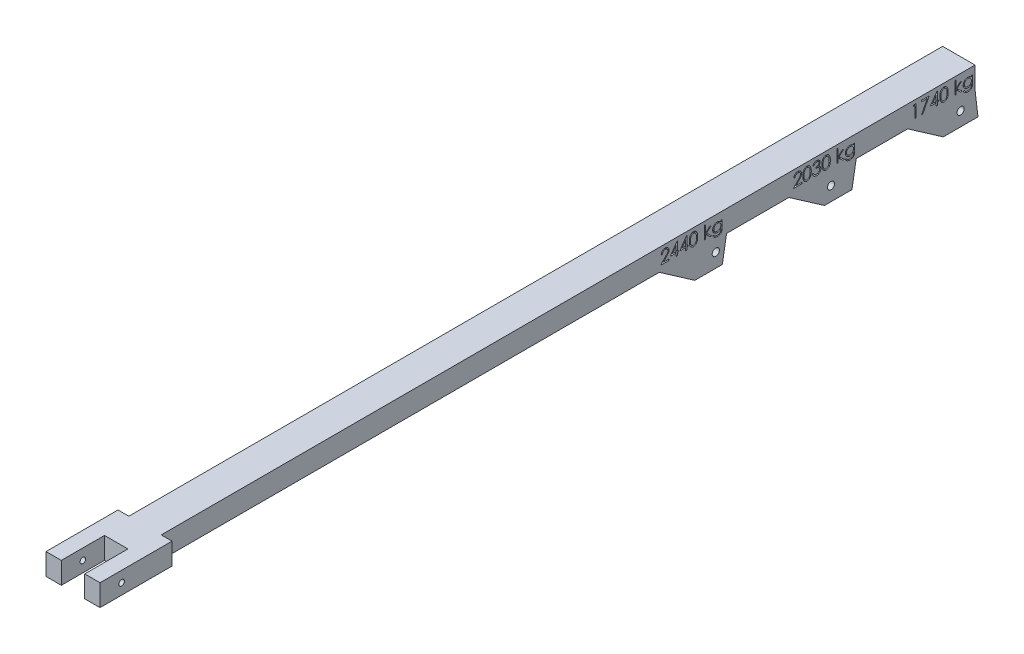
from build123d import *

# Parameters (mm, degrees)
SKETCH1_R           = 38.844894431
SKETCH1_R_2         = 50
BOSS_EXTRUDE1_DEPTH = 375
SKETCH2_W           = 325
SKETCH2_H           = 600
SKETCH2_W_2         = 150
SKETCH2_H_2         = 11923.175795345
CUT_EXTRUDE4_DEPTH  = 700
CUT_EXTRUDE5_DEPTH  = 50


with BuildPart() as part:
    # Sketch1 → Boss-Extrude1 (new, symmetric)
    with BuildSketch(Plane(origin=(0, 0, 0), x_dir=(0, 0, -1), z_dir=(1, 0, 0))):
        Polygon((-300, 150), (12000, 150), (12000, -150), (12040.83940369, -493.821529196), (11559.16059631, -493.821529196), (11064.827480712, -150), (10350, -150), (10290.83940369, -493.821529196), (9909.16059631, -493.821529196), (9414.827480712, -150), (8550, -150), (8490.83940369, -493.821529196), (8109.16059631, -493.821529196), (7614.827480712, -150), (-300, -150), align=None)
        Circle(SKETCH1_R, mode=Mode.SUBTRACT)
        with Locations((11800, -300)):
            Circle(SKETCH1_R_2, mode=Mode.SUBTRACT)
        with Locations((10000, -300)):
            Circle(SKETCH1_R_2, mode=Mode.SUBTRACT)
        with Locations((8400, -300)):
            Circle(SKETCH1_R_2, mode=Mode.SUBTRACT)
    extrude(amount=BOSS_EXTRUDE1_DEPTH, both=True)

    # Sketch2 → Cut-Extrude4 (cut)
    with BuildSketch(Plane(origin=(0, 150, 0), x_dir=(1, 0, 0), z_dir=(0, 1, 0))):
        Rectangle(SKETCH2_W, SKETCH2_H)
        with Locations((300, 6661.587897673)):
            Rectangle(SKETCH2_W_2, SKETCH2_H_2)
        with Locations((-300, 6661.587897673)):
            Rectangle(SKETCH2_W_2, SKETCH2_H_2)
    extrude(amount=-CUT_EXTRUDE4_DEPTH, mode=Mode.SUBTRACT)

    # Sketch3 → Cut-Extrude5 (cut)
    # profile 1 of 18: a face of its own
    with BuildSketch(Plane(origin=(225, 0, 0), x_dir=(0, 0, -1), z_dir=(1, 0, 0))):
        with BuildLine():
            Line((7657.670506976, 44.0625), (7642.236479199, 44.0625))
            add(Edge.make_bspline(
                [(7642.236479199, 44.0625), (7642.337069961, 46.110078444), (7642.534627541, 50.131468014), (7643.459791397, 55.994675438), (7644.783582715, 61.598975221), (7646.655278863, 66.89936891), (7648.979762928, 71.942722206), (7651.767300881, 76.709002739), (7655.068998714, 81.180028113), (7658.813561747, 85.314350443), (7662.880556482, 89.107108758), (7667.268773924, 92.382341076), (7671.880028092, 95.14961713), (7676.700328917, 97.463043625), (7681.784060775, 99.199534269), (7687.085090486, 100.487984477), (7692.626708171, 101.263185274), (7696.402389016, 101.34651093), (7698.322633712, 101.388888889)],
                knots=[0, 0, 0, 0, 1.10065271, 2.161652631, 3.183658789, 4.190468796, 5.17591951, 6.163126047, 7.15150782, 8.156236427, 9.156009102, 10.134482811, 11.092018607, 12.041330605, 13.001268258, 13.972401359, 14.968799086, 16, 16, 16, 16], degree=3))
            add(Edge.make_bspline(
                [(7698.322633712, 101.388888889), (7700.208413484, 101.34474152), (7703.913903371, 101.257993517), (7709.322010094, 100.513027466), (7714.470442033, 99.346242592), (7719.34913556, 97.709226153), (7723.919165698, 95.508658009), (7728.214863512, 92.865213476), (7732.287370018, 89.807923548), (7735.953316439, 86.208457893), (7739.319591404, 82.365834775), (7742.223693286, 78.263497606), (7744.71066748, 74.026457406), (7746.783639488, 69.622405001), (7748.309642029, 65.009873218), (7749.468202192, 60.256015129), (7750.123070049, 55.311623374), (7750.223575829, 51.965078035), (7750.274673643, 50.263671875)],
                knots=[0, 0, 0, 0, 1.111607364, 2.184268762, 3.212621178, 4.221274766, 5.211760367, 6.196651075, 7.1921475, 8.207485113, 9.220403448, 10.201281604, 11.166441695, 12.114753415, 13.065576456, 14.026450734, 14.996634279, 16, 16, 16, 16], degree=3))
            add(Edge.make_bspline(
                [(7750.274673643, 50.263671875), (7750.191471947, 47.86835417), (7750.026528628, 43.119753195), (7748.615593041, 36.141582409), (7746.411974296, 29.38066768), (7743.758711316, 23.939379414), (7741.08210402, 19.554721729), (7738.670095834, 15.944696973), (7735.846452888, 12.057699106), (7732.570077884, 7.906744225), (7728.908745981, 3.459318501), (7724.829293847, -1.281891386), (7720.302631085, -6.267900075), (7717.125512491, -9.67336281), (7715.479209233, -11.437988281)],
                knots=[0, 0, 0, 0, 1.184426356, 2.348067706, 3.509069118, 4.696110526, 5.333549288, 6.050745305, 6.844228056, 7.710549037, 8.667450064, 9.695053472, 10.805634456, 12, 12, 12, 12], degree=3))
            Line((7715.479209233, -11.437988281), (7672.449966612, -57.361111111))
            Line((7672.449966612, -57.361111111), (7752.479534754, -57.361111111))
            Line((7752.479534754, -57.361111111), (7752.479534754, -75))
            Line((7752.479534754, -75), (7635.621895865, -75))
            Line((7635.621895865, -75), (7702.318944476, -3.824327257))
            add(Edge.make_bspline(
                [(7702.318944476, -3.824327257), (7703.942815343, -2.129187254), (7707.061938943, 1.126829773), (7711.473576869, 5.880479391), (7715.435927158, 10.290494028), (7718.974638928, 14.348541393), (7722.012945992, 18.113979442), (7724.709197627, 21.464856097), (7726.869530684, 24.548415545), (7729.214117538, 28.122664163), (7731.484929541, 32.486626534), (7733.436271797, 37.819636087), (7734.626114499, 43.309567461), (7734.768849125, 47.019503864), (7734.840645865, 48.885633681)],
                knots=[0, 0, 0, 0, 1.329631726, 2.553950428, 3.673215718, 4.687767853, 5.603093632, 6.413772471, 7.123043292, 7.734684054, 8.834405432, 9.900288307, 10.943827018, 12, 12, 12, 12], degree=3))
            add(Edge.make_bspline(
                [(7734.840645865, 48.885633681), (7734.809407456, 50.05909168), (7734.747842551, 52.371752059), (7734.204501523, 55.762481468), (7733.383398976, 59.033270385), (7732.206803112, 62.194179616), (7730.653745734, 65.21342877), (7728.76328293, 68.09469305), (7726.582092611, 70.880213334), (7724.058850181, 73.492001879), (7721.286962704, 75.884045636), (7718.358685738, 78.003029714), (7715.26059877, 79.773880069), (7712.005764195, 81.225556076), (7708.60325616, 82.364322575), (7705.046493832, 83.153391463), (7701.345304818, 83.648813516), (7698.818022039, 83.715844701), (7697.530261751, 83.75)],
                knots=[0, 0, 0, 0, 0.991446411, 1.95395049, 2.89581595, 3.838931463, 4.798493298, 5.75982156, 6.748411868, 7.785213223, 8.824556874, 9.840280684, 10.836137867, 11.835679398, 12.848801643, 13.863922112, 14.911575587, 16, 16, 16, 16], degree=3))
            add(Edge.make_bspline(
                [(7697.530261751, 83.75), (7696.185343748, 83.714865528), (7693.544146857, 83.645867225), (7689.666309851, 83.16321192), (7685.966999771, 82.330545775), (7682.436911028, 81.191715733), (7679.070070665, 79.744213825), (7675.882852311, 77.941295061), (7672.882410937, 75.789909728), (7670.063106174, 73.350726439), (7667.465533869, 70.635047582), (7665.183278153, 67.607724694), (7663.189105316, 64.32403235), (7661.449205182, 60.792830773), (7660.036239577, 56.982078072), (7658.956546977, 52.90530186), (7658.102211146, 48.580203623), (7657.816798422, 45.593412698), (7657.670506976, 44.0625)],
                knots=[0, 0, 0, 0, 1.031018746, 2.02475058, 2.990194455, 3.934040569, 4.864654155, 5.795059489, 6.735614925, 7.690564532, 8.649604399, 9.611025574, 10.590972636, 11.591080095, 12.624614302, 13.701020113, 14.821632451, 16, 16, 16, 16], degree=3))
        make_face()
    # profile 2 of 18: a face of its own
    with BuildSketch(Plane(origin=(225, 0, 0), x_dir=(0, 0, -1), z_dir=(1, 0, 0))):
        Polygon((7861.792414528, 101.388888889), (7864.927451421, 101.388888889), (7864.927451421, -17.673611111), (7884.771201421, -17.673611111), (7884.771201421, -35.3125), (7864.927451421, -35.3125), (7864.927451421, -75), (7849.493423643, -75), (7849.493423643, -35.3125), (7767.913562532, -35.3125), align=None)
        Polygon((7849.493423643, -17.673611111), (7849.493423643, 57.016059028), (7798.23040281, -17.673611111), align=None, mode=Mode.SUBTRACT)
    # profile 3 of 18: a face of its own
    with BuildSketch(Plane(origin=(225, 0, 0), x_dir=(0, 0, -1), z_dir=(1, 0, 0))):
        Polygon((7994.084081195, 101.388888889), (7997.219118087, 101.388888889), (7997.219118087, -17.673611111), (8017.062868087, -17.673611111), (8017.062868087, -35.3125), (7997.219118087, -35.3125), (7997.219118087, -75), (7981.78509031, -75), (7981.78509031, -35.3125), (7900.205229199, -35.3125), align=None)
        Polygon((7981.78509031, -17.673611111), (7981.78509031, 57.016059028), (7930.522069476, -17.673611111), align=None, mode=Mode.SUBTRACT)
    # profile 4 of 18: a face of its own
    with BuildSketch(Plane(origin=(225, 0, 0), x_dir=(0, 0, -1), z_dir=(1, 0, 0))):
        with BuildLine():
            add(Edge.make_bspline(
                [(8032.496895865, 10.920681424), (8032.513013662, 13.677133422), (8032.544322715, 19.03158116), (8032.89262578, 26.833766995), (8033.471229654, 34.153214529), (8034.264170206, 40.990274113), (8035.22911977, 47.346710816), (8036.517267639, 53.205537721), (8037.982176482, 58.593871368), (8039.679976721, 63.529282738), (8041.595715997, 68.078264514), (8043.680804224, 72.324931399), (8046.017990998, 76.262857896), (8048.473701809, 79.954896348), (8051.14734259, 83.340610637), (8053.9628278, 86.467814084), (8057.03004559, 89.264232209), (8060.244729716, 91.811799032), (8063.635985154, 94.045045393), (8067.107147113, 96.012130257), (8070.68210782, 97.692605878), (8074.3706277, 99.013918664), (8078.139553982, 100.105290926), (8082.002061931, 100.8516288), (8085.964528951, 101.321225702), (8088.639121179, 101.366120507), (8089.995539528, 101.388888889)],
                knots=[0, 0, 0, 0, 1.646270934, 3.197905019, 4.663502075, 6.030701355, 7.308322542, 8.50163776, 9.611534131, 10.641858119, 11.616356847, 12.558055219, 13.465016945, 14.349605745, 15.204443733, 16.039544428, 16.859896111, 17.680448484, 18.487036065, 19.28249412, 20.06191084, 20.843045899, 21.620316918, 22.403196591, 23.190181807, 24, 24, 24, 24], degree=3))
            add(Edge.make_bspline(
                [(8089.995539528, 101.388888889), (8091.363288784, 101.364919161), (8094.083311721, 101.317250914), (8098.104694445, 100.859101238), (8102.033174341, 100.098898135), (8105.852003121, 99.021769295), (8109.592549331, 97.685457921), (8113.225555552, 96.010522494), (8116.773588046, 94.060825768), (8120.180263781, 91.76987275), (8123.482981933, 89.215624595), (8126.600618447, 86.328208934), (8129.533457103, 83.136780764), (8132.318306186, 79.675485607), (8134.876157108, 75.877935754), (8137.312042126, 71.810180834), (8139.492346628, 67.401083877), (8141.592196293, 62.724210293), (8143.404708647, 57.650153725), (8145.039308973, 52.207516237), (8146.360058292, 46.332010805), (8147.460197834, 40.054464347), (8148.312472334, 33.351822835), (8148.933201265, 26.238454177), (8149.261096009, 18.709678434), (8149.322846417, 13.562201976), (8149.354534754, 10.920681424)],
                knots=[0, 0, 0, 0, 0.810914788, 1.612654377, 2.396697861, 3.181598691, 3.963628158, 4.749916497, 5.551656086, 6.361998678, 7.18212741, 8.025565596, 8.878627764, 9.750805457, 10.657531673, 11.591944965, 12.560506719, 13.57287815, 14.630710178, 15.753379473, 16.941251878, 18.199788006, 19.531962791, 20.947069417, 22.433333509, 24, 24, 24, 24], degree=3))
            add(Edge.make_bspline(
                [(8149.354534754, 10.920681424), (8149.322517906, 8.290682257), (8149.260134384, 3.166236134), (8148.936877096, -4.328663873), (8148.30013007, -11.404282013), (8147.503621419, -18.077587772), (8146.400450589, -24.320805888), (8145.044018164, -30.155540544), (8143.537956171, -35.606988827), (8141.678871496, -40.630491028), (8139.644077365, -45.296124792), (8137.430204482, -49.652954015), (8135.058374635, -53.739488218), (8132.47432648, -57.523017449), (8129.720035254, -61.030343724), (8126.736551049, -64.199557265), (8123.607975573, -67.107020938), (8120.295538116, -69.694158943), (8116.835732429, -71.958623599), (8113.299886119, -73.98374464), (8109.625262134, -75.616696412), (8105.895134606, -77.018820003), (8102.056148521, -78.090026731), (8098.113089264, -78.830709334), (8094.086013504, -79.350177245), (8091.363752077, -79.38980517), (8089.995539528, -79.409722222)],
                knots=[0, 0, 0, 0, 1.561518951, 3.042555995, 4.452378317, 5.7783523, 7.031515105, 8.214008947, 9.334062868, 10.386615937, 11.391082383, 12.354592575, 13.286541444, 14.194233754, 15.072674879, 15.931287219, 16.775624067, 17.606195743, 18.42308326, 19.229000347, 20.022332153, 20.807536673, 21.593273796, 22.3848459, 23.188221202, 24, 24, 24, 24], degree=3))
            add(Edge.make_bspline(
                [(8089.995539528, -79.409722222), (8088.639158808, -79.386806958), (8085.964640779, -79.341622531), (8082.001630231, -78.874147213), (8078.155073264, -78.122573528), (8074.405988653, -77.070227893), (8070.735141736, -75.782111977), (8067.192553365, -74.103905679), (8063.738834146, -72.171151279), (8060.383198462, -69.970042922), (8057.188702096, -67.448254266), (8054.137368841, -64.659032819), (8051.305853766, -61.532775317), (8048.670440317, -58.118845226), (8046.1657314, -54.448650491), (8043.861732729, -50.472080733), (8041.730623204, -46.204903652), (8039.782664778, -41.619550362), (8038.055568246, -36.649110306), (8036.52997997, -31.236720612), (8035.325430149, -25.33461004), (8034.294392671, -18.990182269), (8033.462780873, -12.176174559), (8032.895037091, -4.888887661), (8032.544134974, 2.867137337), (8032.512929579, 8.187178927), (8032.496895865, 10.920681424)],
                knots=[0, 0, 0, 0, 0.810891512, 1.598919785, 2.382837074, 3.152667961, 3.926044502, 4.706494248, 5.493654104, 6.291793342, 7.103789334, 7.925228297, 8.761435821, 9.622817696, 10.50288917, 11.416980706, 12.369136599, 13.353924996, 14.394355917, 15.514179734, 16.714354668, 17.994756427, 19.357759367, 20.818452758, 22.365282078, 24, 24, 24, 24], degree=3))
        make_face()
        with BuildLine():
            add(Edge.make_bspline(
                [(8047.930923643, 10.989583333), (8047.936792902, 8.692496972), (8047.948183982, 4.234303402), (8048.245766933, -2.244066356), (8048.651157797, -8.286447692), (8049.174038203, -13.900512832), (8049.95054618, -19.067258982), (8050.820602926, -23.822221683), (8051.879409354, -28.140237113), (8053.132155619, -32.050935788), (8054.559046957, -35.620686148), (8056.116974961, -38.942400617), (8057.790613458, -42.055318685), (8059.663670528, -44.931479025), (8061.703592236, -47.580261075), (8063.864302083, -50.048546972), (8066.226440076, -52.249731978), (8069.49422814, -54.889703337), (8073.808275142, -57.617741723), (8079.243821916, -59.993318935), (8084.829137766, -61.486218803), (8088.620111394, -61.676071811), (8090.512303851, -61.770833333)],
                knots=[0, 0, 0, 0, 1.459021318, 2.831673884, 4.118529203, 5.306027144, 6.411944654, 7.436330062, 8.375795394, 9.233974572, 10.042671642, 10.816086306, 11.563610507, 12.285937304, 12.993564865, 13.685989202, 14.367179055, 15.041617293, 16.353048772, 17.594441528, 18.799311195, 20, 20, 20, 20], degree=3))
            add(Edge.make_bspline(
                [(8090.512303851, -61.770833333), (8092.416735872, -61.69232333), (8096.221667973, -61.535465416), (8101.78071249, -60.022110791), (8107.177432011, -57.738741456), (8111.406740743, -55.038791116), (8114.624350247, -52.467538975), (8116.929705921, -50.27531325), (8119.045641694, -47.820636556), (8121.052494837, -45.172191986), (8122.89311787, -42.279380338), (8124.566875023, -39.156112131), (8126.094214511, -35.793714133), (8126.964382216, -33.446457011), (8127.409276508, -32.246365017)],
                knots=[0, 0, 0, 0, 1.353760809, 2.704726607, 4.075137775, 5.516104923, 6.260822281, 7.007110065, 7.778089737, 8.566572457, 9.372053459, 10.217411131, 11.088608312, 12, 12, 12, 12], degree=3))
            add(Edge.make_bspline(
                [(8127.409276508, -32.246365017), (8127.927757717, -30.711832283), (8128.980496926, -27.596072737), (8130.337254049, -22.762787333), (8131.405755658, -17.69172295), (8132.367038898, -12.413185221), (8133.023166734, -6.88824634), (8133.551281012, -1.134001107), (8133.862351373, 4.853889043), (8133.900911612, 8.92217864), (8133.920506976, 10.989583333)],
                knots=[0, 0, 0, 0, 0.884706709, 1.796334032, 2.740027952, 3.714592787, 4.726048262, 5.777819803, 6.87074269, 8, 8, 8, 8], degree=3))
            add(Edge.make_bspline(
                [(8133.920506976, 10.989583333), (8133.89347238, 13.056653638), (8133.840586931, 17.100285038), (8133.63843831, 23.022175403), (8133.116428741, 28.646766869), (8132.536656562, 33.998290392), (8131.681810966, 39.047122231), (8130.760110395, 43.835528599), (8129.521800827, 48.304187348), (8128.199046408, 52.523061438), (8126.685118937, 56.444218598), (8125.018604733, 60.08594066), (8123.238779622, 63.465809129), (8121.3056237, 66.574550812), (8119.24208582, 69.426090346), (8116.993701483, 71.963254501), (8114.64965626, 74.264678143), (8111.366466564, 76.89166331), (8107.068250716, 79.570199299), (8101.719912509, 82.035189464), (8096.15414365, 83.450739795), (8092.391561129, 83.650318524), (8090.512303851, 83.75)],
                knots=[0, 0, 0, 0, 1.31362396, 2.569729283, 3.763502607, 4.902122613, 5.988968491, 7.01645872, 7.998833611, 8.933434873, 9.825090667, 10.667526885, 11.477055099, 12.250526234, 12.991942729, 13.710640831, 14.402115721, 15.076753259, 16.378508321, 17.609869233, 18.806226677, 20, 20, 20, 20], degree=3))
            add(Edge.make_bspline(
                [(8090.512303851, 83.75), (8088.610185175, 83.650181), (8084.802482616, 83.450361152), (8079.178864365, 82.040463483), (8073.788332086, 79.582981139), (8069.501482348, 76.882791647), (8066.216002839, 74.311049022), (8063.902505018, 72.080899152), (8061.733298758, 69.641435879), (8059.73501385, 66.96829417), (8057.863424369, 64.095486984), (8056.144565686, 61.000414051), (8054.595901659, 57.667390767), (8053.166777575, 54.099243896), (8051.910209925, 50.188882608), (8050.873717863, 45.876185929), (8049.91618439, 41.136347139), (8049.238327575, 35.941617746), (8048.635724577, 30.32614646), (8048.248459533, 24.268680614), (8047.947188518, 17.779445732), (8047.936453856, 13.298201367), (8047.930923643, 10.989583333)],
                knots=[0, 0, 0, 0, 1.207732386, 2.417664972, 3.655092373, 4.956220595, 5.625982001, 6.301752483, 6.994047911, 7.697131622, 8.419323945, 9.170223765, 9.943494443, 10.752040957, 11.610060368, 12.549350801, 13.567764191, 14.679664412, 15.874934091, 17.154273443, 18.533957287, 20, 20, 20, 20], degree=3))
        make_face(mode=Mode.SUBTRACT)
    # profile 5 of 18: a face of its own
    with BuildSketch(Plane(origin=(225, 0, 0), x_dir=(0, 0, -1), z_dir=(1, 0, 0))):
        Polygon((8241.958701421, 101.388888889), (8257.392729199, 101.388888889), (8257.392729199, -0.5859375), (8314.581314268, 50.677083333), (8336.767729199, 50.677083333), (8270.415190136, -8.854166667), (8343.382312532, -75), (8321.230348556, -75), (8257.392729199, -17.087944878), (8257.392729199, -75), (8241.958701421, -75), align=None)
    # profile 6 of 18: a face of its own
    with BuildSketch(Plane(origin=(225, 0, 0), x_dir=(0, 0, -1), z_dir=(1, 0, 0))):
        with BuildLine():
            Line((8471.264256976, 50.677083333), (8486.698284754, 50.677083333))
            Line((8486.698284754, 50.677083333), (8486.698284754, -49.05843099))
            add(Edge.make_bspline(
                [(8486.698284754, -49.05843099), (8486.68467174, -51.182992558), (8486.658395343, -55.283908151), (8486.469170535, -61.213665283), (8486.070145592, -66.690763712), (8485.617659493, -71.740183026), (8484.966756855, -76.338518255), (8484.171900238, -80.499490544), (8483.275855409, -84.22709291), (8482.488671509, -86.523006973), (8482.116307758, -87.609049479)],
                knots=[0, 0, 0, 0, 1.307562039, 2.523909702, 3.650326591, 4.686913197, 5.643429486, 6.506965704, 7.293745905, 8, 8, 8, 8], degree=3))
            add(Edge.make_bspline(
                [(8482.116307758, -87.609049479), (8481.566503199, -89.0207489), (8480.483332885, -91.801938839), (8478.454684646, -95.744405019), (8476.182893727, -99.456520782), (8473.58813345, -102.917599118), (8470.682137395, -106.110265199), (8467.533371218, -109.103881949), (8464.080511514, -111.835115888), (8460.325532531, -114.256842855), (8456.354993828, -116.437885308), (8452.17117792, -118.327030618), (8447.797677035, -119.972470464), (8443.193406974, -121.204961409), (8438.430555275, -122.272938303), (8433.453113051, -122.967964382), (8428.290161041, -123.441008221), (8424.779556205, -123.484751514), (8422.998469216, -123.506944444)],
                knots=[0, 0, 0, 0, 0.981931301, 1.934503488, 2.87077864, 3.801706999, 4.735015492, 5.667491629, 6.616593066, 7.585388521, 8.561939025, 9.551802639, 10.560317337, 11.588439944, 12.640189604, 13.723962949, 14.845264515, 16, 16, 16, 16], degree=3))
            add(Edge.make_bspline(
                [(8422.998469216, -123.506944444), (8420.399877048, -123.464859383), (8415.324128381, -123.38265595), (8407.923865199, -122.424932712), (8400.895581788, -121.070996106), (8394.332146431, -119.021720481), (8388.275035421, -116.513920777), (8382.765615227, -113.634746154), (8377.853344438, -110.333271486), (8373.424946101, -106.574268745), (8369.428072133, -102.104594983), (8365.667757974, -96.837175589), (8362.048287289, -90.691775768), (8359.927114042, -86.181365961), (8358.81634031, -83.819444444)],
                knots=[0, 0, 0, 0, 1.157897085, 2.2616841, 3.32207898, 4.345638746, 5.321241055, 6.241986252, 7.112515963, 7.955008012, 8.825025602, 9.77857164, 10.836726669, 12, 12, 12, 12], degree=3))
            Line((8358.81634031, -83.819444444), (8374.250368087, -83.819444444))
            add(Edge.make_bspline(
                [(8374.250368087, -83.819444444), (8375.49167486, -85.790123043), (8377.918276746, -89.642557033), (8382.45599526, -94.630599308), (8387.428960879, -98.893391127), (8393.005001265, -102.328590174), (8399.207317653, -104.918586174), (8406.039641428, -106.764919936), (8413.55756927, -107.870316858), (8418.791544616, -108.00354146), (8421.517078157, -108.072916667)],
                knots=[0, 0, 0, 0, 0.997731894, 1.950442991, 2.880492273, 3.800895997, 4.748200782, 5.754801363, 6.83083817, 8, 8, 8, 8], degree=3))
            add(Edge.make_bspline(
                [(8421.517078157, -108.072916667), (8424.208153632, -108.002643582), (8429.396277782, -107.867164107), (8436.856791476, -106.764426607), (8443.666917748, -104.91818437), (8449.787420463, -102.333171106), (8455.146083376, -99.166277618), (8459.765541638, -95.628416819), (8463.507055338, -91.639433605), (8466.023502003, -87.964887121), (8467.587756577, -84.691183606), (8468.583871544, -81.87305456), (8469.393351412, -78.686384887), (8470.070449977, -75.141858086), (8470.629181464, -71.234409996), (8470.983108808, -66.955106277), (8471.238906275, -62.313672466), (8471.255611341, -59.095542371), (8471.264256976, -57.430013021)],
                knots=[0, 0, 0, 0, 1.570740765, 3.028230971, 4.391408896, 5.680370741, 6.894727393, 8.017376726, 9.065722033, 10.075533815, 10.603371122, 11.180248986, 11.817768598, 12.521299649, 13.286540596, 14.121245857, 15.027658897, 16, 16, 16, 16], degree=3))
            Line((8471.264256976, -57.430013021), (8471.264256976, -50.918782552))
            add(Edge.make_bspline(
                [(8471.264256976, -50.918782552), (8469.697717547, -52.783125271), (8466.592193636, -56.479017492), (8461.229031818, -61.322031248), (8455.371081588, -65.493072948), (8449.028315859, -68.913917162), (8442.356101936, -71.64993002), (8435.426706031, -73.563466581), (8428.302245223, -74.799746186), (8423.474438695, -74.932775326), (8421.034764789, -75)],
                knots=[0, 0, 0, 0, 1.012485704, 2.007162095, 2.997754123, 3.998611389, 4.999708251, 5.992315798, 6.98544096, 8, 8, 8, 8], degree=3))
            add(Edge.make_bspline(
                [(8421.034764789, -75), (8419.598185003, -74.974693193), (8416.74202588, -74.92437906), (8412.498820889, -74.484172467), (8408.318231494, -73.845454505), (8404.210007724, -72.907851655), (8400.168221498, -71.704404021), (8396.199552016, -70.199992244), (8392.271865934, -68.499112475), (8388.456557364, -66.495663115), (8384.791625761, -64.266699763), (8381.304714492, -61.852166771), (8378.014087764, -59.264701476), (8374.951065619, -56.478789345), (8372.1196659, -53.498462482), (8369.481806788, -50.355491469), (8367.081107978, -47.005988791), (8364.86830662, -43.511030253), (8362.949139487, -39.847337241), (8361.264511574, -36.09435404), (8359.799769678, -32.260105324), (8358.632011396, -28.33175412), (8357.740121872, -24.311777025), (8357.076271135, -20.206759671), (8356.699738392, -16.00406116), (8356.641023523, -13.172726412), (8356.611479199, -11.748046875)],
                knots=[0, 0, 0, 0, 1.028754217, 2.045334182, 3.052854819, 4.056607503, 5.061168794, 6.071104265, 7.095078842, 8.125279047, 9.155117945, 10.165957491, 11.161587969, 12.151493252, 13.128948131, 14.104219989, 15.088194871, 16.07871515, 17.064853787, 18.047899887, 19.02414258, 20.002704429, 20.980574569, 21.971845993, 22.979467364, 24, 24, 24, 24], degree=3))
            add(Edge.make_bspline(
                [(8356.611479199, -11.748046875), (8356.636989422, -10.322924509), (8356.687911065, -7.478199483), (8357.127734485, -3.258352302), (8357.755123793, 0.904989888), (8358.748071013, 4.968913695), (8359.943204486, 8.979701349), (8361.423383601, 12.907727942), (8363.20306133, 16.754189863), (8365.218153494, 20.52193556), (8367.482583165, 24.160406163), (8369.965592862, 27.616039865), (8372.670180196, 30.863408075), (8375.559032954, 33.935271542), (8378.667424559, 36.801991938), (8381.993746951, 39.456611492), (8385.505211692, 41.943628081), (8389.212701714, 44.209396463), (8393.059010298, 46.213309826), (8396.946418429, 48.041821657), (8400.926420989, 49.493036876), (8404.924815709, 50.771731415), (8409.012019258, 51.677579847), (8413.137917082, 52.376416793), (8417.316634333, 52.802174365), (8420.115123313, 52.855320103), (8421.517078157, 52.881944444)],
                knots=[0, 0, 0, 0, 1.008818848, 2.013730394, 3.001654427, 3.987803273, 4.973046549, 5.963777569, 6.957074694, 7.972068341, 8.987420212, 9.989399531, 10.982630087, 11.977756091, 12.973280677, 13.973972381, 14.989194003, 16.018387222, 17.047741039, 18.059210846, 19.057554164, 20.045176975, 21.029480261, 22.018708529, 23.007435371, 24, 24, 24, 24], degree=3))
            add(Edge.make_bspline(
                [(8421.517078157, 52.881944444), (8423.829015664, 52.815281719), (8428.394381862, 52.683643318), (8435.112920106, 51.6507293), (8441.596153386, 50.003954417), (8447.880666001, 47.644614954), (8454.01765171, 44.423688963), (8459.986884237, 40.18106375), (8465.805633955, 34.878683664), (8469.396452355, 30.812464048), (8471.264256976, 28.697374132)],
                knots=[0, 0, 0, 0, 0.96728863, 1.910097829, 2.838038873, 3.762875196, 4.71315279, 5.730631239, 6.819562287, 8, 8, 8, 8], degree=3))
            Line((8471.264256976, 28.697374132), (8471.264256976, 50.677083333))
        make_face()
        with BuildLine():
            add(Edge.make_bspline(
                [(8422.757312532, 37.447916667), (8420.500419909, 37.37121074), (8416.032251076, 37.219349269), (8409.482874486, 35.922886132), (8403.160088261, 33.891276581), (8397.184773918, 30.985191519), (8391.587731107, 27.442703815), (8386.62122728, 23.151072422), (8382.277283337, 18.249853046), (8378.602681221, 12.783360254), (8375.677494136, 6.885837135), (8373.606696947, 0.66949124), (8372.267715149, -5.765231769), (8372.119928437, -10.156724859), (8372.045506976, -12.368164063)],
                knots=[0, 0, 0, 0, 1.026226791, 2.031711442, 3.026614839, 4.04107745, 5.047145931, 6.032893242, 7.017642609, 8.019221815, 9.021877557, 10.003543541, 10.994637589, 12, 12, 12, 12], degree=3))
            add(Edge.make_bspline(
                [(8372.045506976, -12.368164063), (8372.081168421, -14.035540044), (8372.151304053, -17.314781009), (8372.825638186, -22.127146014), (8373.915542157, -26.710651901), (8375.46026917, -31.065575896), (8377.374284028, -35.216897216), (8379.781617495, -39.136019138), (8382.6144078, -42.826431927), (8385.850482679, -46.260840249), (8389.416661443, -49.388943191), (8393.284679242, -52.137565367), (8397.449289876, -54.385614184), (8401.808067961, -56.328528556), (8406.466775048, -57.747556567), (8411.358309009, -58.830473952), (8416.517276, -59.450029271), (8420.034089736, -59.526820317), (8421.827136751, -59.565972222)],
                knots=[0, 0, 0, 0, 1.039728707, 2.044842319, 3.024901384, 3.974314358, 4.923051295, 5.871625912, 6.837440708, 7.820715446, 8.810779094, 9.792721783, 10.773906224, 11.758876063, 12.764959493, 13.806266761, 14.881525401, 16, 16, 16, 16], degree=3))
            add(Edge.make_bspline(
                [(8421.827136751, -59.565972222), (8423.643421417, -59.52825429), (8427.195146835, -59.454497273), (8432.382575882, -58.820459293), (8437.297875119, -57.797331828), (8441.93653761, -56.344696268), (8446.316077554, -54.4911662), (8450.387296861, -52.145536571), (8454.237490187, -49.474236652), (8457.743723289, -46.358366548), (8460.914241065, -42.924434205), (8463.677246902, -39.187823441), (8466.031614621, -35.204760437), (8467.981252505, -30.975694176), (8469.469668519, -26.46775891), (8470.46807662, -21.692223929), (8471.166152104, -16.671968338), (8471.231058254, -13.231961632), (8471.264256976, -11.472439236)],
                knots=[0, 0, 0, 0, 1.121943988, 2.193949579, 3.223793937, 4.220241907, 5.192961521, 6.155822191, 7.11847367, 8.083710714, 9.04790392, 10.001595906, 10.949595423, 11.902125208, 12.873731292, 13.87582262, 14.913508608, 16, 16, 16, 16], degree=3))
            add(Edge.make_bspline(
                [(8471.264256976, -11.472439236), (8471.198434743, -9.181782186), (8471.069841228, -4.706643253), (8469.856299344, 1.814156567), (8467.899657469, 7.944903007), (8465.155520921, 13.666206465), (8461.716821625, 18.91744535), (8457.575030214, 23.601364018), (8452.80157496, 27.723992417), (8447.410170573, 31.158573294), (8441.609684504, 33.933109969), (8435.540235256, 36.014636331), (8429.210833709, 37.193642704), (8424.920866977, 37.362670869), (8422.757312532, 37.447916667)],
                knots=[0, 0, 0, 0, 1.070913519, 2.092188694, 3.091357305, 4.074328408, 5.051968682, 6.018948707, 6.99050112, 7.9935919, 9.000589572, 9.992915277, 10.987769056, 12, 12, 12, 12], degree=3))
        make_face(mode=Mode.SUBTRACT)
    # profile 7 of 18: a face of its own
    with BuildSketch(Plane(origin=(225, 0, 0), x_dir=(0, 0, -1), z_dir=(1, 0, 0))):
        with BuildLine():
            Line((9498.845021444, 44.0625), (9483.410993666, 44.0625))
            add(Edge.make_bspline(
                [(9483.410993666, 44.0625), (9483.511584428, 46.110078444), (9483.709142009, 50.131468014), (9484.634305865, 55.994675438), (9485.958097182, 61.598975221), (9487.82979333, 66.89936891), (9490.154277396, 71.942722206), (9492.941815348, 76.709002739), (9496.243513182, 81.180028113), (9499.988076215, 85.314350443), (9504.055070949, 89.107108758), (9508.443288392, 92.382341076), (9513.05454256, 95.14961713), (9517.874843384, 97.463043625), (9522.958575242, 99.199534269), (9528.259604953, 100.487984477), (9533.801222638, 101.263185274), (9537.576903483, 101.34651093), (9539.49714818, 101.388888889)],
                knots=[0, 0, 0, 0, 1.10065271, 2.161652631, 3.183658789, 4.190468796, 5.17591951, 6.163126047, 7.15150782, 8.156236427, 9.156009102, 10.134482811, 11.092018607, 12.041330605, 13.001268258, 13.972401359, 14.968799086, 16, 16, 16, 16], degree=3))
            add(Edge.make_bspline(
                [(9539.49714818, 101.388888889), (9541.382927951, 101.34474152), (9545.088417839, 101.257993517), (9550.496524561, 100.513027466), (9555.6449565, 99.346242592), (9560.523650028, 97.709226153), (9565.093680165, 95.508658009), (9569.389377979, 92.865213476), (9573.461884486, 89.807923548), (9577.127830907, 86.208457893), (9580.494105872, 82.365834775), (9583.398207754, 78.263497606), (9585.885181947, 74.026457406), (9587.958153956, 69.622405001), (9589.484156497, 65.009873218), (9590.642716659, 60.256015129), (9591.297584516, 55.311623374), (9591.398090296, 51.965078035), (9591.44918811, 50.263671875)],
                knots=[0, 0, 0, 0, 1.111607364, 2.184268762, 3.212621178, 4.221274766, 5.211760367, 6.196651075, 7.1921475, 8.207485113, 9.220403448, 10.201281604, 11.166441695, 12.114753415, 13.065576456, 14.026450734, 14.996634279, 16, 16, 16, 16], degree=3))
            add(Edge.make_bspline(
                [(9591.44918811, 50.263671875), (9591.365986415, 47.86835417), (9591.201043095, 43.119753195), (9589.790107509, 36.141582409), (9587.586488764, 29.38066768), (9584.933225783, 23.939379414), (9582.256618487, 19.554721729), (9579.844610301, 15.944696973), (9577.020967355, 12.057699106), (9573.744592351, 7.906744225), (9570.083260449, 3.459318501), (9566.003808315, -1.281891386), (9561.477145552, -6.267900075), (9558.300026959, -9.67336281), (9556.653723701, -11.437988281)],
                knots=[0, 0, 0, 0, 1.184426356, 2.348067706, 3.509069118, 4.696110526, 5.333549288, 6.050745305, 6.844228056, 7.710549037, 8.667450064, 9.695053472, 10.805634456, 12, 12, 12, 12], degree=3))
            Line((9556.653723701, -11.437988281), (9513.624481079, -57.361111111))
            Line((9513.624481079, -57.361111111), (9593.654049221, -57.361111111))
            Line((9593.654049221, -57.361111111), (9593.654049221, -75))
            Line((9593.654049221, -75), (9476.796410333, -75))
            Line((9476.796410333, -75), (9543.493458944, -3.824327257))
            add(Edge.make_bspline(
                [(9543.493458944, -3.824327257), (9545.11732981, -2.129187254), (9548.236453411, 1.126829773), (9552.648091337, 5.880479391), (9556.610441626, 10.290494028), (9560.149153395, 14.348541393), (9563.18746046, 18.113979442), (9565.883712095, 21.464856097), (9568.044045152, 24.548415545), (9570.388632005, 28.122664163), (9572.659444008, 32.486626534), (9574.610786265, 37.819636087), (9575.800628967, 43.309567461), (9575.943363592, 47.019503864), (9576.015160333, 48.885633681)],
                knots=[0, 0, 0, 0, 1.329631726, 2.553950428, 3.673215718, 4.687767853, 5.603093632, 6.413772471, 7.123043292, 7.734684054, 8.834405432, 9.900288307, 10.943827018, 12, 12, 12, 12], degree=3))
            add(Edge.make_bspline(
                [(9576.015160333, 48.885633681), (9575.983921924, 50.05909168), (9575.922357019, 52.371752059), (9575.37901599, 55.762481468), (9574.557913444, 59.033270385), (9573.381317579, 62.194179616), (9571.828260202, 65.21342877), (9569.937797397, 68.09469305), (9567.756607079, 70.880213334), (9565.233364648, 73.492001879), (9562.461477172, 75.884045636), (9559.533200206, 78.003029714), (9556.435113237, 79.773880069), (9553.180278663, 81.225556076), (9549.777770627, 82.364322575), (9546.2210083, 83.153391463), (9542.519819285, 83.648813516), (9539.992536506, 83.715844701), (9538.704776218, 83.75)],
                knots=[0, 0, 0, 0, 0.991446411, 1.95395049, 2.89581595, 3.838931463, 4.798493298, 5.75982156, 6.748411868, 7.785213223, 8.824556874, 9.840280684, 10.836137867, 11.835679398, 12.848801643, 13.863922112, 14.911575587, 16, 16, 16, 16], degree=3))
            add(Edge.make_bspline(
                [(9538.704776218, 83.75), (9537.359858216, 83.714865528), (9534.718661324, 83.645867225), (9530.840824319, 83.16321192), (9527.141514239, 82.330545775), (9523.611425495, 81.191715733), (9520.244585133, 79.744213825), (9517.057366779, 77.941295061), (9514.056925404, 75.789909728), (9511.237620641, 73.350726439), (9508.640048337, 70.635047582), (9506.357792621, 67.607724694), (9504.363619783, 64.32403235), (9502.62371965, 60.792830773), (9501.210754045, 56.982078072), (9500.131061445, 52.90530186), (9499.276725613, 48.580203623), (9498.99131289, 45.593412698), (9498.845021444, 44.0625)],
                knots=[0, 0, 0, 0, 1.031018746, 2.02475058, 2.990194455, 3.934040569, 4.864654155, 5.795059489, 6.735614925, 7.690564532, 8.649604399, 9.611025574, 10.590972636, 11.591080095, 12.624614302, 13.701020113, 14.821632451, 16, 16, 16, 16], degree=3))
        make_face()
    # profile 8 of 18: a face of its own
    with BuildSketch(Plane(origin=(225, 0, 0), x_dir=(0, 0, -1), z_dir=(1, 0, 0))):
        with BuildLine():
            add(Edge.make_bspline(
                [(9609.088076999, 10.920681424), (9609.104194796, 13.677133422), (9609.135503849, 19.03158116), (9609.483806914, 26.833766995), (9610.062410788, 34.153214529), (9610.855351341, 40.990274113), (9611.820300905, 47.346710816), (9613.108448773, 53.205537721), (9614.573357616, 58.593871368), (9616.271157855, 63.529282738), (9618.186897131, 68.078264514), (9620.271985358, 72.324931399), (9622.609172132, 76.262857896), (9625.064882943, 79.954896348), (9627.738523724, 83.340610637), (9630.554008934, 86.467814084), (9633.621226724, 89.264232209), (9636.83591085, 91.811799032), (9640.227166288, 94.045045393), (9643.698328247, 96.012130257), (9647.273288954, 97.692605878), (9650.961808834, 99.013918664), (9654.730735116, 100.105290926), (9658.593243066, 100.8516288), (9662.555710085, 101.321225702), (9665.230302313, 101.366120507), (9666.586720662, 101.388888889)],
                knots=[0, 0, 0, 0, 1.646270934, 3.197905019, 4.663502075, 6.030701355, 7.308322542, 8.50163776, 9.611534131, 10.641858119, 11.616356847, 12.558055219, 13.465016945, 14.349605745, 15.204443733, 16.039544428, 16.859896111, 17.680448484, 18.487036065, 19.28249412, 20.06191084, 20.843045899, 21.620316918, 22.403196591, 23.190181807, 24, 24, 24, 24], degree=3))
            add(Edge.make_bspline(
                [(9666.586720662, 101.388888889), (9667.954469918, 101.364919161), (9670.674492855, 101.317250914), (9674.695875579, 100.859101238), (9678.624355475, 100.098898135), (9682.443184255, 99.021769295), (9686.183730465, 97.685457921), (9689.816736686, 96.010522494), (9693.36476918, 94.060825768), (9696.771444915, 91.76987275), (9700.074163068, 89.215624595), (9703.191799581, 86.328208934), (9706.124638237, 83.136780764), (9708.90948732, 79.675485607), (9711.467338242, 75.877935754), (9713.90322326, 71.810180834), (9716.083527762, 67.401083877), (9718.183377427, 62.724210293), (9719.995889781, 57.650153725), (9721.630490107, 52.207516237), (9722.951239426, 46.332010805), (9724.051378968, 40.054464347), (9724.903653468, 33.351822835), (9725.524382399, 26.238454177), (9725.852277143, 18.709678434), (9725.914027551, 13.562201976), (9725.945715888, 10.920681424)],
                knots=[0, 0, 0, 0, 0.810914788, 1.612654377, 2.396697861, 3.181598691, 3.963628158, 4.749916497, 5.551656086, 6.361998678, 7.18212741, 8.025565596, 8.878627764, 9.750805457, 10.657531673, 11.591944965, 12.560506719, 13.57287815, 14.630710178, 15.753379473, 16.941251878, 18.199788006, 19.531962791, 20.947069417, 22.433333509, 24, 24, 24, 24], degree=3))
            add(Edge.make_bspline(
                [(9725.945715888, 10.920681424), (9725.91369904, 8.290682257), (9725.851315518, 3.166236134), (9725.528058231, -4.328663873), (9724.891311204, -11.404282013), (9724.094802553, -18.077587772), (9722.991631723, -24.320805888), (9721.635199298, -30.155540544), (9720.129137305, -35.606988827), (9718.27005263, -40.630491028), (9716.2352585, -45.296124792), (9714.021385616, -49.652954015), (9711.649555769, -53.739488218), (9709.065507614, -57.523017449), (9706.311216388, -61.030343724), (9703.327732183, -64.199557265), (9700.199156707, -67.107020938), (9696.88671925, -69.694158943), (9693.426913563, -71.958623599), (9689.891067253, -73.98374464), (9686.216443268, -75.616696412), (9682.48631574, -77.018820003), (9678.647329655, -78.090026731), (9674.704270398, -78.830709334), (9670.677194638, -79.350177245), (9667.954933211, -79.38980517), (9666.586720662, -79.409722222)],
                knots=[0, 0, 0, 0, 1.561518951, 3.042555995, 4.452378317, 5.7783523, 7.031515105, 8.214008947, 9.334062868, 10.386615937, 11.391082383, 12.354592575, 13.286541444, 14.194233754, 15.072674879, 15.931287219, 16.775624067, 17.606195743, 18.42308326, 19.229000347, 20.022332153, 20.807536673, 21.593273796, 22.3848459, 23.188221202, 24, 24, 24, 24], degree=3))
            add(Edge.make_bspline(
                [(9666.586720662, -79.409722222), (9665.230339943, -79.386806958), (9662.555821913, -79.341622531), (9658.592811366, -78.874147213), (9654.746254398, -78.122573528), (9650.997169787, -77.070227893), (9647.32632287, -75.782111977), (9643.783734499, -74.103905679), (9640.33001528, -72.171151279), (9636.974379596, -69.970042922), (9633.77988323, -67.448254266), (9630.728549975, -64.659032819), (9627.8970349, -61.532775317), (9625.261621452, -58.118845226), (9622.756912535, -54.448650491), (9620.452913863, -50.472080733), (9618.321804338, -46.204903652), (9616.373845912, -41.619550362), (9614.646749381, -36.649110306), (9613.121161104, -31.236720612), (9611.916611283, -25.33461004), (9610.885573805, -18.990182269), (9610.053962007, -12.176174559), (9609.486218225, -4.888887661), (9609.135316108, 2.867137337), (9609.104110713, 8.187178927), (9609.088076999, 10.920681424)],
                knots=[0, 0, 0, 0, 0.810891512, 1.598919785, 2.382837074, 3.152667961, 3.926044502, 4.706494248, 5.493654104, 6.291793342, 7.103789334, 7.925228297, 8.761435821, 9.622817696, 10.50288917, 11.416980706, 12.369136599, 13.353924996, 14.394355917, 15.514179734, 16.714354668, 17.994756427, 19.357759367, 20.818452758, 22.365282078, 24, 24, 24, 24], degree=3))
        make_face()
        with BuildLine():
            add(Edge.make_bspline(
                [(9624.522104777, 10.989583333), (9624.527974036, 8.692496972), (9624.539365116, 4.234303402), (9624.836948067, -2.244066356), (9625.242338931, -8.286447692), (9625.765219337, -13.900512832), (9626.541727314, -19.067258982), (9627.41178406, -23.822221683), (9628.470590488, -28.140237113), (9629.723336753, -32.050935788), (9631.150228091, -35.620686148), (9632.708156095, -38.942400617), (9634.381794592, -42.055318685), (9636.254851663, -44.931479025), (9638.294773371, -47.580261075), (9640.455483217, -50.048546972), (9642.81762121, -52.249731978), (9646.085409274, -54.889703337), (9650.399456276, -57.617741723), (9655.83500305, -59.993318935), (9661.4203189, -61.486218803), (9665.211292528, -61.676071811), (9667.103484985, -61.770833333)],
                knots=[0, 0, 0, 0, 1.459021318, 2.831673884, 4.118529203, 5.306027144, 6.411944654, 7.436330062, 8.375795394, 9.233974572, 10.042671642, 10.816086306, 11.563610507, 12.285937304, 12.993564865, 13.685989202, 14.367179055, 15.041617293, 16.353048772, 17.594441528, 18.799311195, 20, 20, 20, 20], degree=3))
            add(Edge.make_bspline(
                [(9667.103484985, -61.770833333), (9669.007917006, -61.69232333), (9672.812849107, -61.535465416), (9678.371893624, -60.022110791), (9683.768613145, -57.738741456), (9687.997921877, -55.038791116), (9691.215531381, -52.467538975), (9693.520887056, -50.27531325), (9695.636822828, -47.820636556), (9697.643675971, -45.172191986), (9699.484299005, -42.279380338), (9701.158056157, -39.156112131), (9702.685395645, -35.793714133), (9703.55556335, -33.446457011), (9704.000457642, -32.246365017)],
                knots=[0, 0, 0, 0, 1.353760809, 2.704726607, 4.075137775, 5.516104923, 6.260822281, 7.007110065, 7.778089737, 8.566572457, 9.372053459, 10.217411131, 11.088608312, 12, 12, 12, 12], degree=3))
            add(Edge.make_bspline(
                [(9704.000457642, -32.246365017), (9704.518938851, -30.711832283), (9705.57167806, -27.596072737), (9706.928435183, -22.762787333), (9707.996936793, -17.69172295), (9708.958220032, -12.413185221), (9709.614347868, -6.88824634), (9710.142462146, -1.134001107), (9710.453532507, 4.853889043), (9710.492092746, 8.92217864), (9710.51168811, 10.989583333)],
                knots=[0, 0, 0, 0, 0.884706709, 1.796334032, 2.740027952, 3.714592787, 4.726048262, 5.777819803, 6.87074269, 8, 8, 8, 8], degree=3))
            add(Edge.make_bspline(
                [(9710.51168811, 10.989583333), (9710.484653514, 13.056653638), (9710.431768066, 17.100285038), (9710.229619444, 23.022175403), (9709.707609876, 28.646766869), (9709.127837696, 33.998290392), (9708.2729921, 39.047122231), (9707.35129153, 43.835528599), (9706.112981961, 48.304187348), (9704.790227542, 52.523061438), (9703.276300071, 56.444218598), (9701.609785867, 60.08594066), (9699.829960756, 63.465809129), (9697.896804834, 66.574550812), (9695.833266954, 69.426090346), (9693.584882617, 71.963254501), (9691.240837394, 74.264678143), (9687.957647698, 76.89166331), (9683.659431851, 79.570199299), (9678.311093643, 82.035189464), (9672.745324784, 83.450739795), (9668.982742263, 83.650318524), (9667.103484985, 83.75)],
                knots=[0, 0, 0, 0, 1.31362396, 2.569729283, 3.763502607, 4.902122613, 5.988968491, 7.01645872, 7.998833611, 8.933434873, 9.825090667, 10.667526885, 11.477055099, 12.250526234, 12.991942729, 13.710640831, 14.402115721, 15.076753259, 16.378508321, 17.609869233, 18.806226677, 20, 20, 20, 20], degree=3))
            add(Edge.make_bspline(
                [(9667.103484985, 83.75), (9665.201366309, 83.650181), (9661.393663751, 83.450361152), (9655.770045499, 82.040463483), (9650.37951322, 79.582981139), (9646.092663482, 76.882791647), (9642.807183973, 74.311049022), (9640.493686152, 72.080899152), (9638.324479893, 69.641435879), (9636.326194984, 66.96829417), (9634.454605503, 64.095486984), (9632.73574682, 61.000414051), (9631.187082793, 57.667390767), (9629.757958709, 54.099243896), (9628.501391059, 50.188882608), (9627.464898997, 45.876185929), (9626.507365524, 41.136347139), (9625.82950871, 35.941617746), (9625.226905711, 30.32614646), (9624.839640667, 24.268680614), (9624.538369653, 17.779445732), (9624.52763499, 13.298201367), (9624.522104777, 10.989583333)],
                knots=[0, 0, 0, 0, 1.207732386, 2.417664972, 3.655092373, 4.956220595, 5.625982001, 6.301752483, 6.994047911, 7.697131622, 8.419323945, 9.170223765, 9.943494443, 10.752040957, 11.610060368, 12.549350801, 13.567764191, 14.679664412, 15.874934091, 17.154273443, 18.533957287, 20, 20, 20, 20], degree=3))
        make_face(mode=Mode.SUBTRACT)
    # profile 9 of 18: a face of its own
    with BuildSketch(Plane(origin=(225, 0, 0), x_dir=(0, 0, -1), z_dir=(1, 0, 0))):
        with BuildLine():
            Line((9763.428354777, 57.291666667), (9747.994326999, 57.291666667))
            add(Edge.make_bspline(
                [(9747.994326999, 57.291666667), (9748.412459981, 59.022881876), (9749.229875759, 62.407266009), (9750.934807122, 67.242694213), (9752.792145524, 71.818495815), (9755.022425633, 76.048990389), (9757.455132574, 80.019198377), (9760.24231154, 83.63907113), (9763.255372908, 87.000672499), (9766.588080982, 89.98393307), (9770.083123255, 92.685368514), (9773.789746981, 94.988663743), (9777.633377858, 96.970067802), (9781.640646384, 98.602407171), (9785.823482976, 99.832083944), (9790.144072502, 100.724253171), (9794.613737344, 101.303632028), (9797.647822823, 101.360176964), (9799.188445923, 101.388888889)],
                knots=[0, 0, 0, 0, 1.162005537, 2.271625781, 3.343758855, 4.383309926, 5.390229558, 6.379919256, 7.361854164, 8.333198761, 9.295911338, 10.242430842, 11.177959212, 12.116337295, 13.062827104, 14.020064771, 14.994644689, 16, 16, 16, 16], degree=3))
            add(Edge.make_bspline(
                [(9799.188445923, 101.388888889), (9801.433154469, 101.321117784), (9805.873607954, 101.187053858), (9812.397173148, 99.962835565), (9818.688014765, 98.025606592), (9824.677275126, 95.348936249), (9830.240478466, 92.047559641), (9835.19034288, 88.11833998), (9839.459775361, 83.637088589), (9843.041579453, 78.687402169), (9845.846068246, 73.397543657), (9847.914062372, 67.953166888), (9849.173032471, 62.367186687), (9849.336194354, 58.59557157), (9849.41793811, 56.706000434)],
                knots=[0, 0, 0, 0, 1.083050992, 2.142477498, 3.193116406, 4.255571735, 5.30263384, 6.308962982, 7.297363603, 8.282367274, 9.249857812, 10.179914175, 11.08814088, 12, 12, 12, 12], degree=3))
            add(Edge.make_bspline(
                [(9849.41793811, 56.706000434), (9849.360762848, 54.887601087), (9849.248879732, 51.329275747), (9848.298881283, 46.134448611), (9846.700150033, 41.238368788), (9844.485561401, 36.620425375), (9841.618838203, 32.309898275), (9838.146200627, 28.297089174), (9834.043138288, 24.564199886), (9830.933807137, 22.425787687), (9829.333031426, 21.324869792)],
                knots=[0, 0, 0, 0, 1.024540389, 2.004866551, 2.965041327, 3.920577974, 4.882998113, 5.874504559, 6.905732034, 8, 8, 8, 8], degree=3))
            add(Edge.make_bspline(
                [(9829.333031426, 21.324869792), (9831.162484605, 20.441478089), (9834.78716048, 18.691223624), (9839.727902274, 15.25872792), (9844.213014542, 11.295524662), (9846.714265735, 8.20271752), (9847.970998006, 6.648763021)],
                knots=[0, 0, 0, 0, 1.015518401, 2.012035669, 3.001164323, 4, 4, 4, 4], degree=3))
            add(Edge.make_bspline(
                [(9847.970998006, 6.648763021), (9848.798529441, 5.515776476), (9850.440040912, 3.268356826), (9852.466227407, -0.34499553), (9854.304395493, -3.998397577), (9855.736747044, -7.789771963), (9856.845956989, -11.675175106), (9857.638831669, -15.661278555), (9858.131386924, -19.751337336), (9858.201925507, -22.518358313), (9858.237382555, -23.909233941)],
                knots=[0, 0, 0, 0, 1.025084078, 2.033381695, 3.024893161, 4.013698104, 4.991890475, 5.976764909, 6.982997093, 8, 8, 8, 8], degree=3))
            add(Edge.make_bspline(
                [(9858.237382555, -23.909233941), (9858.149205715, -26.317419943), (9857.973266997, -31.122458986), (9856.400685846, -38.221499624), (9853.962844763, -45.160883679), (9850.50080901, -51.798043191), (9846.281545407, -58.007983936), (9841.261850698, -63.564203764), (9835.498759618, -68.340242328), (9829.071374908, -72.33066157), (9822.107833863, -75.52052733), (9814.659878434, -77.734510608), (9806.834823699, -79.176482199), (9801.46871512, -79.331109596), (9798.74058351, -79.409722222)],
                knots=[0, 0, 0, 0, 0.955779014, 1.907060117, 2.875433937, 3.871313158, 4.872415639, 5.851225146, 6.836215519, 7.83643374, 8.849228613, 9.86973379, 10.916971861, 12, 12, 12, 12], degree=3))
            add(Edge.make_bspline(
                [(9798.74058351, -79.409722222), (9796.901914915, -79.36706091), (9793.284028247, -79.283117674), (9787.965277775, -78.709267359), (9782.888369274, -77.661176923), (9778.046438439, -76.250785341), (9773.435183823, -74.462607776), (9769.06867675, -72.235787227), (9764.920053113, -69.616225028), (9761.028461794, -66.573000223), (9757.394366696, -63.168729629), (9754.114344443, -59.342978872), (9751.133709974, -55.16646953), (9748.532272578, -50.590690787), (9746.191540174, -45.674776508), (9744.266309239, -40.355780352), (9742.571795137, -34.681252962), (9741.783960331, -30.726825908), (9741.379743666, -28.697916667)],
                knots=[0, 0, 0, 0, 1.048658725, 2.063410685, 3.046034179, 4.001477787, 4.936774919, 5.862367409, 6.792675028, 7.730719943, 8.675894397, 9.627829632, 10.600096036, 11.597688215, 12.626045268, 13.701542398, 14.82072376, 16, 16, 16, 16], degree=3))
            Line((9741.379743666, -28.697916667), (9756.813771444, -28.697916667))
            add(Edge.make_bspline(
                [(9756.813771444, -28.697916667), (9757.215873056, -30.022107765), (9757.997995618, -32.597774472), (9759.32932556, -36.304677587), (9760.846096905, -39.702890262), (9762.473243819, -42.81734069), (9764.182149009, -45.678700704), (9766.09430798, -48.211308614), (9768.068095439, -50.526403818), (9769.555929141, -51.830723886), (9770.284094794, -52.469075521)],
                knots=[0, 0, 0, 0, 1.198163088, 2.33053128, 3.407730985, 4.417276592, 5.372219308, 6.28897303, 7.162600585, 8, 8, 8, 8], degree=3))
            add(Edge.make_bspline(
                [(9770.284094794, -52.469075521), (9771.247009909, -53.211452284), (9773.169867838, -54.693914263), (9776.303241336, -56.585765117), (9779.598602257, -58.225022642), (9783.127353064, -59.477212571), (9786.813346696, -60.537472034), (9790.716161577, -61.231310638), (9794.80136537, -61.707357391), (9797.590757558, -61.749366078), (9799.016191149, -61.770833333)],
                knots=[0, 0, 0, 0, 0.946170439, 1.889420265, 2.845303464, 3.807233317, 4.801018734, 5.828864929, 6.890507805, 8, 8, 8, 8], degree=3))
            add(Edge.make_bspline(
                [(9799.016191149, -61.770833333), (9800.625596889, -61.740569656), (9803.772650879, -61.681391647), (9808.364733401, -61.137165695), (9812.733370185, -60.344567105), (9816.830057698, -59.120420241), (9820.708458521, -57.607944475), (9824.314205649, -55.708881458), (9827.694633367, -53.480782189), (9830.806444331, -50.94830746), (9833.60457031, -48.175929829), (9836.068270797, -45.276210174), (9838.162714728, -42.261374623), (9839.852217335, -39.114739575), (9841.18631134, -35.849335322), (9842.094518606, -32.455998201), (9842.72600228, -28.962498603), (9842.777429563, -26.587762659), (9842.803354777, -25.390625)],
                knots=[0, 0, 0, 0, 1.217147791, 2.380027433, 3.494444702, 4.572153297, 5.609568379, 6.639424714, 7.649109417, 8.668170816, 9.669597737, 10.625200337, 11.543417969, 12.441394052, 13.322311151, 14.205496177, 15.095365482, 16, 16, 16, 16], degree=3))
            add(Edge.make_bspline(
                [(9842.803354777, -25.390625), (9842.728160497, -23.788204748), (9842.578146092, -20.591337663), (9841.432834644, -15.888072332), (9839.548981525, -11.356499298), (9836.911680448, -7.073933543), (9833.701284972, -3.104855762), (9829.948949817, 0.436513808), (9825.623515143, 3.35869001), (9821.642449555, 5.377659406), (9818.116131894, 6.755314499), (9815.098369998, 7.672944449), (9811.719883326, 8.449978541), (9808.021527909, 9.172894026), (9803.975437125, 9.788154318), (9799.586015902, 10.301232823), (9794.852374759, 10.711773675), (9791.575377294, 10.895108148), (9789.88668811, 10.989583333)],
                knots=[0, 0, 0, 0, 1.07054697, 2.135767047, 3.216561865, 4.33974944, 5.486079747, 6.621378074, 7.775625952, 8.963672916, 9.598146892, 10.304877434, 11.070270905, 11.915000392, 12.823868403, 13.805723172, 14.86925407, 16, 16, 16, 16], degree=3))
            Line((9789.88668811, 10.989583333), (9789.88668811, 28.628472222))
            add(Edge.make_bspline(
                [(9789.88668811, 28.628472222), (9792.014373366, 28.664578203), (9796.18198611, 28.735300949), (9802.269768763, 29.590676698), (9808.091180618, 30.773924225), (9813.517208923, 32.586348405), (9818.462775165, 34.691387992), (9822.753390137, 37.140971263), (9826.328942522, 39.863880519), (9829.172056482, 42.902143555), (9831.310948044, 46.160659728), (9832.874818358, 49.556838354), (9833.798608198, 53.120446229), (9833.921925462, 55.552461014), (9833.983910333, 56.774902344)],
                knots=[0, 0, 0, 0, 1.321986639, 2.589447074, 3.816329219, 5.01088745, 6.139805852, 7.153945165, 8.075214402, 8.924034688, 9.728124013, 10.488707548, 11.240355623, 12, 12, 12, 12], degree=3))
            add(Edge.make_bspline(
                [(9833.983910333, 56.774902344), (9833.963547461, 57.673014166), (9833.923036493, 59.459765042), (9833.412146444, 62.070166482), (9832.644429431, 64.600763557), (9831.588982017, 67.04079465), (9830.176286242, 69.373336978), (9828.485682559, 71.618276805), (9826.472636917, 73.762797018), (9824.165882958, 75.761702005), (9821.688802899, 77.66670232), (9818.973999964, 79.283976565), (9816.10332987, 80.6669378), (9813.073614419, 81.807380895), (9809.875021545, 82.665276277), (9806.522579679, 83.281248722), (9803.009896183, 83.666366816), (9800.613404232, 83.721813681), (9799.395151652, 83.75)],
                knots=[0, 0, 0, 0, 0.884392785, 1.759457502, 2.611959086, 3.489218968, 4.37281399, 5.2945488, 6.255912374, 7.266815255, 8.301784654, 9.332968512, 10.37626691, 11.440494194, 12.520033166, 13.637162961, 14.798855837, 16, 16, 16, 16], degree=3))
            add(Edge.make_bspline(
                [(9799.395151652, 83.75), (9797.436964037, 83.681632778), (9793.612168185, 83.548095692), (9788.0982745, 82.378489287), (9782.972345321, 80.512363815), (9779.054234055, 78.284839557), (9776.160926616, 76.085941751), (9774.093396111, 74.165554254), (9772.063034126, 72.031399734), (9770.203414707, 69.552031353), (9768.322749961, 66.895356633), (9766.610596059, 63.926323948), (9764.946835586, 60.722381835), (9763.944317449, 58.45738503), (9763.428354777, 57.291666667)],
                knots=[0, 0, 0, 0, 1.472543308, 2.876219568, 4.221790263, 5.565193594, 6.249813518, 6.953379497, 7.687249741, 8.463570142, 9.283606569, 10.136032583, 11.040678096, 12, 12, 12, 12], degree=3))
        make_face()
    # profile 10 of 18: a face of its own
    with BuildSketch(Plane(origin=(225, 0, 0), x_dir=(0, 0, -1), z_dir=(1, 0, 0))):
        with BuildLine():
            add(Edge.make_bspline(
                [(9873.671410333, 10.920681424), (9873.68752813, 13.677133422), (9873.718837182, 19.03158116), (9874.067140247, 26.833766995), (9874.645744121, 34.153214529), (9875.438684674, 40.990274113), (9876.403634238, 47.346710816), (9877.691782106, 53.205537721), (9879.156690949, 58.593871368), (9880.854491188, 63.529282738), (9882.770230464, 68.078264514), (9884.855318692, 72.324931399), (9887.192505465, 76.262857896), (9889.648216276, 79.954896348), (9892.321857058, 83.340610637), (9895.137342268, 86.467814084), (9898.204560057, 89.264232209), (9901.419244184, 91.811799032), (9904.810499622, 94.045045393), (9908.28166158, 96.012130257), (9911.856622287, 97.692605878), (9915.545142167, 99.013918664), (9919.314068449, 100.105290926), (9923.176576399, 100.8516288), (9927.139043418, 101.321225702), (9929.813635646, 101.366120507), (9931.170053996, 101.388888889)],
                knots=[0, 0, 0, 0, 1.646270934, 3.197905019, 4.663502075, 6.030701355, 7.308322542, 8.50163776, 9.611534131, 10.641858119, 11.616356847, 12.558055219, 13.465016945, 14.349605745, 15.204443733, 16.039544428, 16.859896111, 17.680448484, 18.487036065, 19.28249412, 20.06191084, 20.843045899, 21.620316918, 22.403196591, 23.190181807, 24, 24, 24, 24], degree=3))
            add(Edge.make_bspline(
                [(9931.170053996, 101.388888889), (9932.537803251, 101.364919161), (9935.257826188, 101.317250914), (9939.279208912, 100.859101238), (9943.207688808, 100.098898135), (9947.026517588, 99.021769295), (9950.767063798, 97.685457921), (9954.400070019, 96.010522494), (9957.948102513, 94.060825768), (9961.354778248, 91.76987275), (9964.657496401, 89.215624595), (9967.775132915, 86.328208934), (9970.70797157, 83.136780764), (9973.492820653, 79.675485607), (9976.050671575, 75.877935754), (9978.486556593, 71.810180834), (9980.666861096, 67.401083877), (9982.76671076, 62.724210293), (9984.579223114, 57.650153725), (9986.21382344, 52.207516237), (9987.534572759, 46.332010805), (9988.634712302, 40.054464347), (9989.486986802, 33.351822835), (9990.107715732, 26.238454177), (9990.435610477, 18.709678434), (9990.497360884, 13.562201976), (9990.529049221, 10.920681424)],
                knots=[0, 0, 0, 0, 0.810914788, 1.612654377, 2.396697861, 3.181598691, 3.963628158, 4.749916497, 5.551656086, 6.361998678, 7.18212741, 8.025565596, 8.878627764, 9.750805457, 10.657531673, 11.591944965, 12.560506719, 13.57287815, 14.630710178, 15.753379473, 16.941251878, 18.199788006, 19.531962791, 20.947069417, 22.433333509, 24, 24, 24, 24], degree=3))
            add(Edge.make_bspline(
                [(9990.529049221, 10.920681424), (9990.497032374, 8.290682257), (9990.434648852, 3.166236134), (9990.111391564, -4.328663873), (9989.474644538, -11.404282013), (9988.678135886, -18.077587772), (9987.574965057, -24.320805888), (9986.218532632, -30.155540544), (9984.712470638, -35.606988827), (9982.853385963, -40.630491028), (9980.818591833, -45.296124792), (9978.604718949, -49.652954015), (9976.232889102, -53.739488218), (9973.648840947, -57.523017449), (9970.894549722, -61.030343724), (9967.911065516, -64.199557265), (9964.78249004, -67.107020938), (9961.470052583, -69.694158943), (9958.010246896, -71.958623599), (9954.474400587, -73.98374464), (9950.799776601, -75.616696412), (9947.069649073, -77.018820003), (9943.230662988, -78.090026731), (9939.287603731, -78.830709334), (9935.260527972, -79.350177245), (9932.538266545, -79.38980517), (9931.170053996, -79.409722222)],
                knots=[0, 0, 0, 0, 1.561518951, 3.042555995, 4.452378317, 5.7783523, 7.031515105, 8.214008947, 9.334062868, 10.386615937, 11.391082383, 12.354592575, 13.286541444, 14.194233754, 15.072674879, 15.931287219, 16.775624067, 17.606195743, 18.42308326, 19.229000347, 20.022332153, 20.807536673, 21.593273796, 22.3848459, 23.188221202, 24, 24, 24, 24], degree=3))
            add(Edge.make_bspline(
                [(9931.170053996, -79.409722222), (9929.813673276, -79.386806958), (9927.139155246, -79.341622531), (9923.176144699, -78.874147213), (9919.329587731, -78.122573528), (9915.58050312, -77.070227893), (9911.909656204, -75.782111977), (9908.367067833, -74.103905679), (9904.913348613, -72.171151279), (9901.557712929, -69.970042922), (9898.363216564, -67.448254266), (9895.311883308, -64.659032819), (9892.480368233, -61.532775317), (9889.844954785, -58.118845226), (9887.340245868, -54.448650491), (9885.036247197, -50.472080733), (9882.905137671, -46.204903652), (9880.957179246, -41.619550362), (9879.230082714, -36.649110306), (9877.704494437, -31.236720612), (9876.499944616, -25.33461004), (9875.468907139, -18.990182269), (9874.637295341, -12.176174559), (9874.069551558, -4.888887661), (9873.718649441, 2.867137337), (9873.687444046, 8.187178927), (9873.671410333, 10.920681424)],
                knots=[0, 0, 0, 0, 0.810891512, 1.598919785, 2.382837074, 3.152667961, 3.926044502, 4.706494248, 5.493654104, 6.291793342, 7.103789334, 7.925228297, 8.761435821, 9.622817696, 10.50288917, 11.416980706, 12.369136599, 13.353924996, 14.394355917, 15.514179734, 16.714354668, 17.994756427, 19.357759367, 20.818452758, 22.365282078, 24, 24, 24, 24], degree=3))
        make_face()
        with BuildLine():
            add(Edge.make_bspline(
                [(9889.10543811, 10.989583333), (9889.11130737, 8.692496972), (9889.122698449, 4.234303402), (9889.4202814, -2.244066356), (9889.825672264, -8.286447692), (9890.34855267, -13.900512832), (9891.125060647, -19.067258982), (9891.995117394, -23.822221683), (9893.053923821, -28.140237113), (9894.306670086, -32.050935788), (9895.733561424, -35.620686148), (9897.291489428, -38.942400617), (9898.965127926, -42.055318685), (9900.838184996, -44.931479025), (9902.878106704, -47.580261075), (9905.03881655, -50.048546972), (9907.400954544, -52.249731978), (9910.668742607, -54.889703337), (9914.98278961, -57.617741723), (9920.418336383, -59.993318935), (9926.003652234, -61.486218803), (9929.794625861, -61.676071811), (9931.686818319, -61.770833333)],
                knots=[0, 0, 0, 0, 1.459021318, 2.831673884, 4.118529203, 5.306027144, 6.411944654, 7.436330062, 8.375795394, 9.233974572, 10.042671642, 10.816086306, 11.563610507, 12.285937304, 12.993564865, 13.685989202, 14.367179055, 15.041617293, 16.353048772, 17.594441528, 18.799311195, 20, 20, 20, 20], degree=3))
            add(Edge.make_bspline(
                [(9931.686818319, -61.770833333), (9933.59125034, -61.69232333), (9937.39618244, -61.535465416), (9942.955226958, -60.022110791), (9948.351946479, -57.738741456), (9952.581255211, -55.038791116), (9955.798864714, -52.467538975), (9958.104220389, -50.27531325), (9960.220156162, -47.820636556), (9962.227009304, -45.172191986), (9964.067632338, -42.279380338), (9965.741389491, -39.156112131), (9967.268728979, -35.793714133), (9968.138896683, -33.446457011), (9968.583790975, -32.246365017)],
                knots=[0, 0, 0, 0, 1.353760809, 2.704726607, 4.075137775, 5.516104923, 6.260822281, 7.007110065, 7.778089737, 8.566572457, 9.372053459, 10.217411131, 11.088608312, 12, 12, 12, 12], degree=3))
            add(Edge.make_bspline(
                [(9968.583790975, -32.246365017), (9969.102272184, -30.711832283), (9970.155011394, -27.596072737), (9971.511768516, -22.762787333), (9972.580270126, -17.69172295), (9973.541553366, -12.413185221), (9974.197681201, -6.88824634), (9974.725795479, -1.134001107), (9975.03686584, 4.853889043), (9975.075426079, 8.92217864), (9975.095021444, 10.989583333)],
                knots=[0, 0, 0, 0, 0.884706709, 1.796334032, 2.740027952, 3.714592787, 4.726048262, 5.777819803, 6.87074269, 8, 8, 8, 8], degree=3))
            add(Edge.make_bspline(
                [(9975.095021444, 10.989583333), (9975.067986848, 13.056653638), (9975.015101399, 17.100285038), (9974.812952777, 23.022175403), (9974.290943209, 28.646766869), (9973.711171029, 33.998290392), (9972.856325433, 39.047122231), (9971.934624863, 43.835528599), (9970.696315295, 48.304187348), (9969.373560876, 52.523061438), (9967.859633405, 56.444218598), (9966.193119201, 60.08594066), (9964.41329409, 63.465809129), (9962.480138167, 66.574550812), (9960.416600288, 69.426090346), (9958.168215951, 71.963254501), (9955.824170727, 74.264678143), (9952.540981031, 76.89166331), (9948.242765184, 79.570199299), (9942.894426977, 82.035189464), (9937.328658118, 83.450739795), (9933.566075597, 83.650318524), (9931.686818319, 83.75)],
                knots=[0, 0, 0, 0, 1.31362396, 2.569729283, 3.763502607, 4.902122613, 5.988968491, 7.01645872, 7.998833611, 8.933434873, 9.825090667, 10.667526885, 11.477055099, 12.250526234, 12.991942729, 13.710640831, 14.402115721, 15.076753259, 16.378508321, 17.609869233, 18.806226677, 20, 20, 20, 20], degree=3))
            add(Edge.make_bspline(
                [(9931.686818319, 83.75), (9929.784699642, 83.650181), (9925.976997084, 83.450361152), (9920.353378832, 82.040463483), (9914.962846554, 79.582981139), (9910.675996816, 76.882791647), (9907.390517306, 74.311049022), (9905.077019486, 72.080899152), (9902.907813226, 69.641435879), (9900.909528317, 66.96829417), (9899.037938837, 64.095486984), (9897.319080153, 61.000414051), (9895.770416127, 57.667390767), (9894.341292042, 54.099243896), (9893.084724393, 50.188882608), (9892.04823233, 45.876185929), (9891.090698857, 41.136347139), (9890.412842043, 35.941617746), (9889.810239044, 30.32614646), (9889.422974, 24.268680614), (9889.121702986, 17.779445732), (9889.110968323, 13.298201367), (9889.10543811, 10.989583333)],
                knots=[0, 0, 0, 0, 1.207732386, 2.417664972, 3.655092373, 4.956220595, 5.625982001, 6.301752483, 6.994047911, 7.697131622, 8.419323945, 9.170223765, 9.943494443, 10.752040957, 11.610060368, 12.549350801, 13.567764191, 14.679664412, 15.874934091, 17.154273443, 18.533957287, 20, 20, 20, 20], degree=3))
        make_face(mode=Mode.SUBTRACT)
    # profile 11 of 18: a face of its own
    with BuildSketch(Plane(origin=(225, 0, 0), x_dir=(0, 0, -1), z_dir=(1, 0, 0))):
        Polygon((10083.133215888, 101.388888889), (10098.567243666, 101.388888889), (10098.567243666, -0.5859375), (10155.755828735, 50.677083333), (10177.942243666, 50.677083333), (10111.589704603, -8.854166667), (10184.556826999, -75), (10162.404863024, -75), (10098.567243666, -17.087944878), (10098.567243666, -75), (10083.133215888, -75), align=None)
    # profile 12 of 18: a face of its own
    with BuildSketch(Plane(origin=(225, 0, 0), x_dir=(0, 0, -1), z_dir=(1, 0, 0))):
        with BuildLine():
            Line((10312.438771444, 50.677083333), (10327.872799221, 50.677083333))
            Line((10327.872799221, 50.677083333), (10327.872799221, -49.05843099))
            add(Edge.make_bspline(
                [(10327.872799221, -49.05843099), (10327.859186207, -51.182992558), (10327.83290981, -55.283908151), (10327.643685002, -61.213665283), (10327.244660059, -66.690763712), (10326.792173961, -71.740183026), (10326.141271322, -76.338518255), (10325.346414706, -80.499490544), (10324.450369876, -84.22709291), (10323.663185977, -86.523006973), (10323.290822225, -87.609049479)],
                knots=[0, 0, 0, 0, 1.307562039, 2.523909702, 3.650326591, 4.686913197, 5.643429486, 6.506965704, 7.293745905, 8, 8, 8, 8], degree=3))
            add(Edge.make_bspline(
                [(10323.290822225, -87.609049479), (10322.741017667, -89.0207489), (10321.657847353, -91.801938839), (10319.629199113, -95.744405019), (10317.357408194, -99.456520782), (10314.762647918, -102.917599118), (10311.856651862, -106.110265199), (10308.707885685, -109.103881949), (10305.255025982, -111.835115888), (10301.500046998, -114.256842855), (10297.529508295, -116.437885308), (10293.345692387, -118.327030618), (10288.972191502, -119.972470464), (10284.367921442, -121.204961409), (10279.605069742, -122.272938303), (10274.627627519, -122.967964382), (10269.464675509, -123.441008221), (10265.954070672, -123.484751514), (10264.172983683, -123.506944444)],
                knots=[0, 0, 0, 0, 0.981931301, 1.934503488, 2.87077864, 3.801706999, 4.735015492, 5.667491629, 6.616593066, 7.585388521, 8.561939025, 9.551802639, 10.560317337, 11.588439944, 12.640189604, 13.723962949, 14.845264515, 16, 16, 16, 16], degree=3))
            add(Edge.make_bspline(
                [(10264.172983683, -123.506944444), (10261.574391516, -123.464859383), (10256.498642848, -123.38265595), (10249.098379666, -122.424932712), (10242.070096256, -121.070996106), (10235.506660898, -119.021720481), (10229.449549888, -116.513920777), (10223.940129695, -113.634746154), (10219.027858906, -110.333271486), (10214.599460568, -106.574268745), (10210.602586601, -102.104594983), (10206.842272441, -96.837175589), (10203.222801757, -90.691775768), (10201.101628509, -86.181365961), (10199.990854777, -83.819444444)],
                knots=[0, 0, 0, 0, 1.157897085, 2.2616841, 3.32207898, 4.345638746, 5.321241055, 6.241986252, 7.112515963, 7.955008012, 8.825025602, 9.77857164, 10.836726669, 12, 12, 12, 12], degree=3))
            Line((10199.990854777, -83.819444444), (10215.424882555, -83.819444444))
            add(Edge.make_bspline(
                [(10215.424882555, -83.819444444), (10216.666189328, -85.790123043), (10219.092791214, -89.642557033), (10223.630509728, -94.630599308), (10228.603475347, -98.893391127), (10234.179515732, -102.328590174), (10240.38183212, -104.918586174), (10247.214155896, -106.764919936), (10254.732083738, -107.870316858), (10259.966059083, -108.00354146), (10262.691592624, -108.072916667)],
                knots=[0, 0, 0, 0, 0.997731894, 1.950442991, 2.880492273, 3.800895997, 4.748200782, 5.754801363, 6.83083817, 8, 8, 8, 8], degree=3))
            add(Edge.make_bspline(
                [(10262.691592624, -108.072916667), (10265.382668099, -108.002643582), (10270.57079225, -107.867164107), (10278.031305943, -106.764426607), (10284.841432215, -104.91818437), (10290.961934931, -102.333171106), (10296.320597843, -99.166277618), (10300.940056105, -95.628416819), (10304.681569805, -91.639433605), (10307.198016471, -87.964887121), (10308.762271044, -84.691183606), (10309.758386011, -81.87305456), (10310.567865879, -78.686384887), (10311.244964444, -75.141858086), (10311.803695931, -71.234409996), (10312.157623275, -66.955106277), (10312.413420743, -62.313672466), (10312.430125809, -59.095542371), (10312.438771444, -57.430013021)],
                knots=[0, 0, 0, 0, 1.570740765, 3.028230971, 4.391408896, 5.680370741, 6.894727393, 8.017376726, 9.065722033, 10.075533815, 10.603371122, 11.180248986, 11.817768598, 12.521299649, 13.286540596, 14.121245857, 15.027658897, 16, 16, 16, 16], degree=3))
            Line((10312.438771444, -57.430013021), (10312.438771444, -50.918782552))
            add(Edge.make_bspline(
                [(10312.438771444, -50.918782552), (10310.872232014, -52.783125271), (10307.766708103, -56.479017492), (10302.403546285, -61.322031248), (10296.545596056, -65.493072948), (10290.202830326, -68.913917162), (10283.530616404, -71.64993002), (10276.601220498, -73.563466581), (10269.476759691, -74.799746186), (10264.648953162, -74.932775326), (10262.209279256, -75)],
                knots=[0, 0, 0, 0, 1.012485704, 2.007162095, 2.997754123, 3.998611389, 4.999708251, 5.992315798, 6.98544096, 8, 8, 8, 8], degree=3))
            add(Edge.make_bspline(
                [(10262.209279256, -75), (10260.77269947, -74.974693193), (10257.916540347, -74.92437906), (10253.673335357, -74.484172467), (10249.492745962, -73.845454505), (10245.384522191, -72.907851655), (10241.342735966, -71.704404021), (10237.374066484, -70.199992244), (10233.446380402, -68.499112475), (10229.631071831, -66.495663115), (10225.966140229, -64.266699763), (10222.479228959, -61.852166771), (10219.188602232, -59.264701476), (10216.125580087, -56.478789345), (10213.294180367, -53.498462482), (10210.656321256, -50.355491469), (10208.255622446, -47.005988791), (10206.042821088, -43.511030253), (10204.123653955, -39.847337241), (10202.439026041, -36.09435404), (10200.974284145, -32.260105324), (10199.806525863, -28.33175412), (10198.914636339, -24.311777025), (10198.250785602, -20.206759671), (10197.874252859, -16.00406116), (10197.81553799, -13.172726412), (10197.785993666, -11.748046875)],
                knots=[0, 0, 0, 0, 1.028754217, 2.045334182, 3.052854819, 4.056607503, 5.061168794, 6.071104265, 7.095078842, 8.125279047, 9.155117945, 10.165957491, 11.161587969, 12.151493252, 13.128948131, 14.104219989, 15.088194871, 16.07871515, 17.064853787, 18.047899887, 19.02414258, 20.002704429, 20.980574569, 21.971845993, 22.979467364, 24, 24, 24, 24], degree=3))
            add(Edge.make_bspline(
                [(10197.785993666, -11.748046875), (10197.81150389, -10.322924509), (10197.862425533, -7.478199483), (10198.302248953, -3.258352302), (10198.92963826, 0.904989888), (10199.922585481, 4.968913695), (10201.117718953, 8.979701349), (10202.597898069, 12.907727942), (10204.377575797, 16.754189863), (10206.392667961, 20.52193556), (10208.657097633, 24.160406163), (10211.14010733, 27.616039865), (10213.844694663, 30.863408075), (10216.733547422, 33.935271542), (10219.841939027, 36.801991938), (10223.168261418, 39.456611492), (10226.679726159, 41.943628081), (10230.387216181, 44.209396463), (10234.233524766, 46.213309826), (10238.120932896, 48.041821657), (10242.100935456, 49.493036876), (10246.099330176, 50.771731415), (10250.186533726, 51.677579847), (10254.312431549, 52.376416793), (10258.4911488, 52.802174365), (10261.28963778, 52.855320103), (10262.691592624, 52.881944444)],
                knots=[0, 0, 0, 0, 1.008818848, 2.013730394, 3.001654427, 3.987803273, 4.973046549, 5.963777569, 6.957074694, 7.972068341, 8.987420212, 9.989399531, 10.982630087, 11.977756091, 12.973280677, 13.973972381, 14.989194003, 16.018387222, 17.047741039, 18.059210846, 19.057554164, 20.045176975, 21.029480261, 22.018708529, 23.007435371, 24, 24, 24, 24], degree=3))
            add(Edge.make_bspline(
                [(10262.691592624, 52.881944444), (10265.003530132, 52.815281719), (10269.568896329, 52.683643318), (10276.287434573, 51.6507293), (10282.770667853, 50.003954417), (10289.055180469, 47.644614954), (10295.192166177, 44.423688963), (10301.161398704, 40.18106375), (10306.980148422, 34.878683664), (10310.570966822, 30.812464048), (10312.438771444, 28.697374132)],
                knots=[0, 0, 0, 0, 0.96728863, 1.910097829, 2.838038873, 3.762875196, 4.71315279, 5.730631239, 6.819562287, 8, 8, 8, 8], degree=3))
            Line((10312.438771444, 28.697374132), (10312.438771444, 50.677083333))
        make_face()
        with BuildLine():
            add(Edge.make_bspline(
                [(10263.931826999, 37.447916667), (10261.674934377, 37.37121074), (10257.206765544, 37.219349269), (10250.657388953, 35.922886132), (10244.334602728, 33.891276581), (10238.359288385, 30.985191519), (10232.762245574, 27.442703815), (10227.795741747, 23.151072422), (10223.451797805, 18.249853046), (10219.777195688, 12.783360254), (10216.852008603, 6.885837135), (10214.781211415, 0.66949124), (10213.442229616, -5.765231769), (10213.294442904, -10.156724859), (10213.220021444, -12.368164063)],
                knots=[0, 0, 0, 0, 1.026226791, 2.031711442, 3.026614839, 4.04107745, 5.047145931, 6.032893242, 7.017642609, 8.019221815, 9.021877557, 10.003543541, 10.994637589, 12, 12, 12, 12], degree=3))
            add(Edge.make_bspline(
                [(10213.220021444, -12.368164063), (10213.255682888, -14.035540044), (10213.325818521, -17.314781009), (10214.000152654, -22.127146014), (10215.090056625, -26.710651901), (10216.634783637, -31.065575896), (10218.548798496, -35.216897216), (10220.956131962, -39.136019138), (10223.788922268, -42.826431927), (10227.024997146, -46.260840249), (10230.59117591, -49.388943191), (10234.45919371, -52.137565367), (10238.623804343, -54.385614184), (10242.982582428, -56.328528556), (10247.641289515, -57.747556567), (10252.532823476, -58.830473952), (10257.691790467, -59.450029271), (10261.208604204, -59.526820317), (10263.001651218, -59.565972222)],
                knots=[0, 0, 0, 0, 1.039728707, 2.044842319, 3.024901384, 3.974314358, 4.923051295, 5.871625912, 6.837440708, 7.820715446, 8.810779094, 9.792721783, 10.773906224, 11.758876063, 12.764959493, 13.806266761, 14.881525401, 16, 16, 16, 16], degree=3))
            add(Edge.make_bspline(
                [(10263.001651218, -59.565972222), (10264.817935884, -59.52825429), (10268.369661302, -59.454497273), (10273.557090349, -58.820459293), (10278.472389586, -57.797331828), (10283.111052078, -56.344696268), (10287.490592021, -54.4911662), (10291.561811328, -52.145536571), (10295.412004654, -49.474236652), (10298.918237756, -46.358366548), (10302.088755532, -42.924434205), (10304.85176137, -39.187823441), (10307.206129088, -35.204760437), (10309.155766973, -30.975694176), (10310.644182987, -26.46775891), (10311.642591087, -21.692223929), (10312.340666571, -16.671968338), (10312.405572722, -13.231961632), (10312.438771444, -11.472439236)],
                knots=[0, 0, 0, 0, 1.121943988, 2.193949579, 3.223793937, 4.220241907, 5.192961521, 6.155822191, 7.11847367, 8.083710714, 9.04790392, 10.001595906, 10.949595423, 11.902125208, 12.873731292, 13.87582262, 14.913508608, 16, 16, 16, 16], degree=3))
            add(Edge.make_bspline(
                [(10312.438771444, -11.472439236), (10312.37294921, -9.181782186), (10312.244355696, -4.706643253), (10311.030813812, 1.814156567), (10309.074171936, 7.944903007), (10306.330035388, 13.666206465), (10302.891336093, 18.91744535), (10298.749544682, 23.601364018), (10293.976089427, 27.723992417), (10288.584685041, 31.158573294), (10282.784198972, 33.933109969), (10276.714749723, 36.014636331), (10270.385348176, 37.193642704), (10266.095381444, 37.362670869), (10263.931826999, 37.447916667)],
                knots=[0, 0, 0, 0, 1.070913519, 2.092188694, 3.091357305, 4.074328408, 5.051968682, 6.018948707, 6.99050112, 7.9935919, 9.000589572, 9.992915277, 10.987769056, 12, 12, 12, 12], degree=3))
        make_face(mode=Mode.SUBTRACT)
    # profile 13 of 18: a face of its own
    with BuildSketch(Plane(origin=(225, 0, 0), x_dir=(0, 0, -1), z_dir=(1, 0, 0))):
        Polygon((11150.488217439, 96.979166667), (11182.286448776, 96.979166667), (11182.286448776, -75), (11166.852420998, -75), (11166.852420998, 79.340277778), (11140.394087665, 79.340277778), align=None)
    # profile 14 of 18: a face of its own
    with BuildSketch(Plane(origin=(225, 0, 0), x_dir=(0, 0, -1), z_dir=(1, 0, 0))):
        Polygon((11257.251726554, 96.979166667), (11363.085059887, 96.979166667), (11272.685754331, -79.409722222), (11259.3532348, -72.071668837), (11336.971236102, 79.340277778), (11257.251726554, 79.340277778), align=None)
    # profile 15 of 18: a face of its own
    with BuildSketch(Plane(origin=(225, 0, 0), x_dir=(0, 0, -1), z_dir=(1, 0, 0))):
        Polygon((11472.397939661, 101.388888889), (11475.532976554, 101.388888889), (11475.532976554, -17.673611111), (11495.376726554, -17.673611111), (11495.376726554, -35.3125), (11475.532976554, -35.3125), (11475.532976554, -75), (11460.098948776, -75), (11460.098948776, -35.3125), (11378.519087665, -35.3125), align=None)
        Polygon((11460.098948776, -17.673611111), (11460.098948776, 57.016059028), (11408.835927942, -17.673611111), align=None, mode=Mode.SUBTRACT)
    # profile 16 of 18: a face of its own
    with BuildSketch(Plane(origin=(225, 0, 0), x_dir=(0, 0, -1), z_dir=(1, 0, 0))):
        with BuildLine():
            add(Edge.make_bspline(
                [(11510.810754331, 10.920681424), (11510.826872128, 13.677133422), (11510.858181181, 19.03158116), (11511.206484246, 26.833766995), (11511.78508812, 34.153214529), (11512.578028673, 40.990274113), (11513.542978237, 47.346710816), (11514.831126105, 53.205537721), (11516.296034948, 58.593871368), (11517.993835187, 63.529282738), (11519.909574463, 68.078264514), (11521.99466269, 72.324931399), (11524.331849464, 76.262857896), (11526.787560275, 79.954896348), (11529.461201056, 83.340610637), (11532.276686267, 86.467814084), (11535.343904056, 89.264232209), (11538.558588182, 91.811799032), (11541.94984362, 94.045045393), (11545.421005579, 96.012130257), (11548.995966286, 97.692605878), (11552.684486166, 99.013918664), (11556.453412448, 100.105290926), (11560.315920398, 100.8516288), (11564.278387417, 101.321225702), (11566.952979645, 101.366120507), (11568.309397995, 101.388888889)],
                knots=[0, 0, 0, 0, 1.646270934, 3.197905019, 4.663502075, 6.030701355, 7.308322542, 8.50163776, 9.611534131, 10.641858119, 11.616356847, 12.558055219, 13.465016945, 14.349605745, 15.204443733, 16.039544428, 16.859896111, 17.680448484, 18.487036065, 19.28249412, 20.06191084, 20.843045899, 21.620316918, 22.403196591, 23.190181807, 24, 24, 24, 24], degree=3))
            add(Edge.make_bspline(
                [(11568.309397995, 101.388888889), (11569.67714725, 101.364919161), (11572.397170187, 101.317250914), (11576.418552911, 100.859101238), (11580.347032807, 100.098898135), (11584.165861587, 99.021769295), (11587.906407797, 97.685457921), (11591.539414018, 96.010522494), (11595.087446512, 94.060825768), (11598.494122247, 91.76987275), (11601.7968404, 89.215624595), (11604.914476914, 86.328208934), (11607.847315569, 83.136780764), (11610.632164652, 79.675485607), (11613.190015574, 75.877935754), (11615.625900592, 71.810180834), (11617.806205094, 67.401083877), (11619.906054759, 62.724210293), (11621.718567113, 57.650153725), (11623.353167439, 52.207516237), (11624.673916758, 46.332010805), (11625.7740563, 40.054464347), (11626.626330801, 33.351822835), (11627.247059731, 26.238454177), (11627.574954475, 18.709678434), (11627.636704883, 13.562201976), (11627.66839322, 10.920681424)],
                knots=[0, 0, 0, 0, 0.810914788, 1.612654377, 2.396697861, 3.181598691, 3.963628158, 4.749916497, 5.551656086, 6.361998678, 7.18212741, 8.025565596, 8.878627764, 9.750805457, 10.657531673, 11.591944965, 12.560506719, 13.57287815, 14.630710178, 15.753379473, 16.941251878, 18.199788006, 19.531962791, 20.947069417, 22.433333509, 24, 24, 24, 24], degree=3))
            add(Edge.make_bspline(
                [(11627.66839322, 10.920681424), (11627.636376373, 8.290682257), (11627.573992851, 3.166236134), (11627.250735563, -4.328663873), (11626.613988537, -11.404282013), (11625.817479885, -18.077587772), (11624.714309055, -24.320805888), (11623.35787663, -30.155540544), (11621.851814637, -35.606988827), (11619.992729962, -40.630491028), (11617.957935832, -45.296124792), (11615.744062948, -49.652954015), (11613.372233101, -53.739488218), (11610.788184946, -57.523017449), (11608.03389372, -61.030343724), (11605.050409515, -64.199557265), (11601.921834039, -67.107020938), (11598.609396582, -69.694158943), (11595.149590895, -71.958623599), (11591.613744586, -73.98374464), (11587.9391206, -75.616696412), (11584.208993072, -77.018820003), (11580.370006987, -78.090026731), (11576.42694773, -78.830709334), (11572.39987197, -79.350177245), (11569.677610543, -79.38980517), (11568.309397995, -79.409722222)],
                knots=[0, 0, 0, 0, 1.561518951, 3.042555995, 4.452378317, 5.7783523, 7.031515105, 8.214008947, 9.334062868, 10.386615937, 11.391082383, 12.354592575, 13.286541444, 14.194233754, 15.072674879, 15.931287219, 16.775624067, 17.606195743, 18.42308326, 19.229000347, 20.022332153, 20.807536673, 21.593273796, 22.3848459, 23.188221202, 24, 24, 24, 24], degree=3))
            add(Edge.make_bspline(
                [(11568.309397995, -79.409722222), (11566.953017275, -79.386806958), (11564.278499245, -79.341622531), (11560.315488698, -78.874147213), (11556.46893173, -78.122573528), (11552.719847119, -77.070227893), (11549.049000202, -75.782111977), (11545.506411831, -74.103905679), (11542.052692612, -72.171151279), (11538.697056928, -69.970042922), (11535.502560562, -67.448254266), (11532.451227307, -64.659032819), (11529.619712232, -61.532775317), (11526.984298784, -58.118845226), (11524.479589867, -54.448650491), (11522.175591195, -50.472080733), (11520.04448167, -46.204903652), (11518.096523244, -41.619550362), (11516.369426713, -36.649110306), (11514.843838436, -31.236720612), (11513.639288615, -25.33461004), (11512.608251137, -18.990182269), (11511.776639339, -12.176174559), (11511.208895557, -4.888887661), (11510.85799344, 2.867137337), (11510.826788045, 8.187178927), (11510.810754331, 10.920681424)],
                knots=[0, 0, 0, 0, 0.810891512, 1.598919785, 2.382837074, 3.152667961, 3.926044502, 4.706494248, 5.493654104, 6.291793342, 7.103789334, 7.925228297, 8.761435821, 9.622817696, 10.50288917, 11.416980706, 12.369136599, 13.353924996, 14.394355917, 15.514179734, 16.714354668, 17.994756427, 19.357759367, 20.818452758, 22.365282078, 24, 24, 24, 24], degree=3))
        make_face()
        with BuildLine():
            add(Edge.make_bspline(
                [(11526.244782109, 10.989583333), (11526.250651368, 8.692496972), (11526.262042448, 4.234303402), (11526.559625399, -2.244066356), (11526.965016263, -8.286447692), (11527.487896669, -13.900512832), (11528.264404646, -19.067258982), (11529.134461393, -23.822221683), (11530.19326782, -28.140237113), (11531.446014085, -32.050935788), (11532.872905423, -35.620686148), (11534.430833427, -38.942400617), (11536.104471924, -42.055318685), (11537.977528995, -44.931479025), (11540.017450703, -47.580261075), (11542.178160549, -50.048546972), (11544.540298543, -52.249731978), (11547.808086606, -54.889703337), (11552.122133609, -57.617741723), (11557.557680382, -59.993318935), (11563.142996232, -61.486218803), (11566.93396986, -61.676071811), (11568.826162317, -61.770833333)],
                knots=[0, 0, 0, 0, 1.459021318, 2.831673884, 4.118529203, 5.306027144, 6.411944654, 7.436330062, 8.375795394, 9.233974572, 10.042671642, 10.816086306, 11.563610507, 12.285937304, 12.993564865, 13.685989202, 14.367179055, 15.041617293, 16.353048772, 17.594441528, 18.799311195, 20, 20, 20, 20], degree=3))
            add(Edge.make_bspline(
                [(11568.826162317, -61.770833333), (11570.730594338, -61.69232333), (11574.535526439, -61.535465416), (11580.094570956, -60.022110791), (11585.491290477, -57.738741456), (11589.720599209, -55.038791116), (11592.938208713, -52.467538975), (11595.243564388, -50.27531325), (11597.35950016, -47.820636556), (11599.366353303, -45.172191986), (11601.206976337, -42.279380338), (11602.880733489, -39.156112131), (11604.408072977, -35.793714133), (11605.278240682, -33.446457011), (11605.723134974, -32.246365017)],
                knots=[0, 0, 0, 0, 1.353760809, 2.704726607, 4.075137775, 5.516104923, 6.260822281, 7.007110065, 7.778089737, 8.566572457, 9.372053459, 10.217411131, 11.088608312, 12, 12, 12, 12], degree=3))
            add(Edge.make_bspline(
                [(11605.723134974, -32.246365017), (11606.241616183, -30.711832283), (11607.294355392, -27.596072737), (11608.651112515, -22.762787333), (11609.719614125, -17.69172295), (11610.680897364, -12.413185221), (11611.3370252, -6.88824634), (11611.865139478, -1.134001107), (11612.176209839, 4.853889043), (11612.214770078, 8.92217864), (11612.234365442, 10.989583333)],
                knots=[0, 0, 0, 0, 0.884706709, 1.796334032, 2.740027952, 3.714592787, 4.726048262, 5.777819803, 6.87074269, 8, 8, 8, 8], degree=3))
            add(Edge.make_bspline(
                [(11612.234365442, 10.989583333), (11612.207330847, 13.056653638), (11612.154445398, 17.100285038), (11611.952296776, 23.022175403), (11611.430287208, 28.646766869), (11610.850515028, 33.998290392), (11609.995669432, 39.047122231), (11609.073968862, 43.835528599), (11607.835659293, 48.304187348), (11606.512904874, 52.523061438), (11604.998977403, 56.444218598), (11603.332463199, 60.08594066), (11601.552638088, 63.465809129), (11599.619482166, 66.574550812), (11597.555944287, 69.426090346), (11595.30755995, 71.963254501), (11592.963514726, 74.264678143), (11589.68032503, 76.89166331), (11585.382109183, 79.570199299), (11580.033770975, 82.035189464), (11574.468002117, 83.450739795), (11570.705419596, 83.650318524), (11568.826162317, 83.75)],
                knots=[0, 0, 0, 0, 1.31362396, 2.569729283, 3.763502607, 4.902122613, 5.988968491, 7.01645872, 7.998833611, 8.933434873, 9.825090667, 10.667526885, 11.477055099, 12.250526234, 12.991942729, 13.710640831, 14.402115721, 15.076753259, 16.378508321, 17.609869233, 18.806226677, 20, 20, 20, 20], degree=3))
            add(Edge.make_bspline(
                [(11568.826162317, 83.75), (11566.924043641, 83.650181), (11563.116341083, 83.450361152), (11557.492722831, 82.040463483), (11552.102190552, 79.582981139), (11547.815340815, 76.882791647), (11544.529861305, 74.311049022), (11542.216363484, 72.080899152), (11540.047157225, 69.641435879), (11538.048872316, 66.96829417), (11536.177282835, 64.095486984), (11534.458424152, 61.000414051), (11532.909760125, 57.667390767), (11531.480636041, 54.099243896), (11530.224068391, 50.188882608), (11529.187576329, 45.876185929), (11528.230042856, 41.136347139), (11527.552186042, 35.941617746), (11526.949583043, 30.32614646), (11526.562317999, 24.268680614), (11526.261046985, 17.779445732), (11526.250312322, 13.298201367), (11526.244782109, 10.989583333)],
                knots=[0, 0, 0, 0, 1.207732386, 2.417664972, 3.655092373, 4.956220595, 5.625982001, 6.301752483, 6.994047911, 7.697131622, 8.419323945, 9.170223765, 9.943494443, 10.752040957, 11.610060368, 12.549350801, 13.567764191, 14.679664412, 15.874934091, 17.154273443, 18.533957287, 20, 20, 20, 20], degree=3))
        make_face(mode=Mode.SUBTRACT)
    # profile 17 of 18: a face of its own
    with BuildSketch(Plane(origin=(225, 0, 0), x_dir=(0, 0, -1), z_dir=(1, 0, 0))):
        Polygon((11720.272559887, 101.388888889), (11735.706587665, 101.388888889), (11735.706587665, -0.5859375), (11792.895172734, 50.677083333), (11815.081587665, 50.677083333), (11748.729048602, -8.854166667), (11821.696170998, -75), (11799.544207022, -75), (11735.706587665, -17.087944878), (11735.706587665, -75), (11720.272559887, -75), align=None)
    # profile 18 of 18: a face of its own
    with BuildSketch(Plane(origin=(225, 0, 0), x_dir=(0, 0, -1), z_dir=(1, 0, 0))):
        with BuildLine():
            Line((11949.578115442, 50.677083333), (11965.01214322, 50.677083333))
            Line((11965.01214322, 50.677083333), (11965.01214322, -49.05843099))
            add(Edge.make_bspline(
                [(11965.01214322, -49.05843099), (11964.998530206, -51.182992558), (11964.972253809, -55.283908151), (11964.783029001, -61.213665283), (11964.384004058, -66.690763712), (11963.931517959, -71.740183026), (11963.280615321, -76.338518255), (11962.485758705, -80.499490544), (11961.589713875, -84.22709291), (11960.802529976, -86.523006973), (11960.430166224, -87.609049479)],
                knots=[0, 0, 0, 0, 1.307562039, 2.523909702, 3.650326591, 4.686913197, 5.643429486, 6.506965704, 7.293745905, 8, 8, 8, 8], degree=3))
            add(Edge.make_bspline(
                [(11960.430166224, -87.609049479), (11959.880361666, -89.0207489), (11958.797191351, -91.801938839), (11956.768543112, -95.744405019), (11954.496752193, -99.456520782), (11951.901991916, -102.917599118), (11948.995995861, -106.110265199), (11945.847229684, -109.103881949), (11942.394369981, -111.835115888), (11938.639390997, -114.256842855), (11934.668852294, -116.437885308), (11930.485036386, -118.327030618), (11926.111535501, -119.972470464), (11921.507265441, -121.204961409), (11916.744413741, -122.272938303), (11911.766971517, -122.967964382), (11906.604019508, -123.441008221), (11903.093414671, -123.484751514), (11901.312327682, -123.506944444)],
                knots=[0, 0, 0, 0, 0.981931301, 1.934503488, 2.87077864, 3.801706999, 4.735015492, 5.667491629, 6.616593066, 7.585388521, 8.561939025, 9.551802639, 10.560317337, 11.588439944, 12.640189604, 13.723962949, 14.845264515, 16, 16, 16, 16], degree=3))
            add(Edge.make_bspline(
                [(11901.312327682, -123.506944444), (11898.713735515, -123.464859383), (11893.637986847, -123.38265595), (11886.237723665, -122.424932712), (11879.209440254, -121.070996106), (11872.646004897, -119.021720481), (11866.588893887, -116.513920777), (11861.079473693, -113.634746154), (11856.167202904, -110.333271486), (11851.738804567, -106.574268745), (11847.7419306, -102.104594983), (11843.98161644, -96.837175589), (11840.362145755, -90.691775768), (11838.240972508, -86.181365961), (11837.130198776, -83.819444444)],
                knots=[0, 0, 0, 0, 1.157897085, 2.2616841, 3.32207898, 4.345638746, 5.321241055, 6.241986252, 7.112515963, 7.955008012, 8.825025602, 9.77857164, 10.836726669, 12, 12, 12, 12], degree=3))
            Line((11837.130198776, -83.819444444), (11852.564226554, -83.819444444))
            add(Edge.make_bspline(
                [(11852.564226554, -83.819444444), (11853.805533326, -85.790123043), (11856.232135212, -89.642557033), (11860.769853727, -94.630599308), (11865.742819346, -98.893391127), (11871.318859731, -102.328590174), (11877.521176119, -104.918586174), (11884.353499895, -106.764919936), (11891.871427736, -107.870316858), (11897.105403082, -108.00354146), (11899.830936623, -108.072916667)],
                knots=[0, 0, 0, 0, 0.997731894, 1.950442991, 2.880492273, 3.800895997, 4.748200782, 5.754801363, 6.83083817, 8, 8, 8, 8], degree=3))
            add(Edge.make_bspline(
                [(11899.830936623, -108.072916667), (11902.522012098, -108.002643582), (11907.710136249, -107.867164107), (11915.170649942, -106.764426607), (11921.980776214, -104.91818437), (11928.101278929, -102.333171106), (11933.459941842, -99.166277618), (11938.079400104, -95.628416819), (11941.820913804, -91.639433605), (11944.33736047, -87.964887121), (11945.901615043, -84.691183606), (11946.89773001, -81.87305456), (11947.707209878, -78.686384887), (11948.384308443, -75.141858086), (11948.94303993, -71.234409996), (11949.296967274, -66.955106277), (11949.552764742, -62.313672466), (11949.569469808, -59.095542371), (11949.578115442, -57.430013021)],
                knots=[0, 0, 0, 0, 1.570740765, 3.028230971, 4.391408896, 5.680370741, 6.894727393, 8.017376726, 9.065722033, 10.075533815, 10.603371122, 11.180248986, 11.817768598, 12.521299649, 13.286540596, 14.121245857, 15.027658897, 16, 16, 16, 16], degree=3))
            Line((11949.578115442, -57.430013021), (11949.578115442, -50.918782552))
            add(Edge.make_bspline(
                [(11949.578115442, -50.918782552), (11948.011576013, -52.783125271), (11944.906052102, -56.479017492), (11939.542890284, -61.322031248), (11933.684940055, -65.493072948), (11927.342174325, -68.913917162), (11920.669960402, -71.64993002), (11913.740564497, -73.563466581), (11906.61610369, -74.799746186), (11901.788297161, -74.932775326), (11899.348623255, -75)],
                knots=[0, 0, 0, 0, 1.012485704, 2.007162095, 2.997754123, 3.998611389, 4.999708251, 5.992315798, 6.98544096, 8, 8, 8, 8], degree=3))
            add(Edge.make_bspline(
                [(11899.348623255, -75), (11897.912043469, -74.974693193), (11895.055884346, -74.92437906), (11890.812679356, -74.484172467), (11886.63208996, -73.845454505), (11882.52386619, -72.907851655), (11878.482079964, -71.704404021), (11874.513410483, -70.199992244), (11870.5857244, -68.499112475), (11866.77041583, -66.495663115), (11863.105484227, -64.266699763), (11859.618572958, -61.852166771), (11856.327946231, -59.264701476), (11853.264924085, -56.478789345), (11850.433524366, -53.498462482), (11847.795665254, -50.355491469), (11845.394966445, -47.005988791), (11843.182165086, -43.511030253), (11841.262997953, -39.847337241), (11839.57837004, -36.09435404), (11838.113628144, -32.260105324), (11836.945869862, -28.33175412), (11836.053980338, -24.311777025), (11835.390129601, -20.206759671), (11835.013596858, -16.00406116), (11834.954881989, -13.172726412), (11834.925337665, -11.748046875)],
                knots=[0, 0, 0, 0, 1.028754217, 2.045334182, 3.052854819, 4.056607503, 5.061168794, 6.071104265, 7.095078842, 8.125279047, 9.155117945, 10.165957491, 11.161587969, 12.151493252, 13.128948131, 14.104219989, 15.088194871, 16.07871515, 17.064853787, 18.047899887, 19.02414258, 20.002704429, 20.980574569, 21.971845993, 22.979467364, 24, 24, 24, 24], degree=3))
            add(Edge.make_bspline(
                [(11834.925337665, -11.748046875), (11834.950847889, -10.322924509), (11835.001769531, -7.478199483), (11835.441592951, -3.258352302), (11836.068982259, 0.904989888), (11837.06192948, 4.968913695), (11838.257062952, 8.979701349), (11839.737242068, 12.907727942), (11841.516919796, 16.754189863), (11843.53201196, 20.52193556), (11845.796441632, 24.160406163), (11848.279451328, 27.616039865), (11850.984038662, 30.863408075), (11853.87289142, 33.935271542), (11856.981283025, 36.801991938), (11860.307605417, 39.456611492), (11863.819070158, 41.943628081), (11867.52656018, 44.209396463), (11871.372868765, 46.213309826), (11875.260276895, 48.041821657), (11879.240279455, 49.493036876), (11883.238674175, 50.771731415), (11887.325877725, 51.677579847), (11891.451775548, 52.376416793), (11895.630492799, 52.802174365), (11898.428981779, 52.855320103), (11899.830936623, 52.881944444)],
                knots=[0, 0, 0, 0, 1.008818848, 2.013730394, 3.001654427, 3.987803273, 4.973046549, 5.963777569, 6.957074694, 7.972068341, 8.987420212, 9.989399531, 10.982630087, 11.977756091, 12.973280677, 13.973972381, 14.989194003, 16.018387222, 17.047741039, 18.059210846, 19.057554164, 20.045176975, 21.029480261, 22.018708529, 23.007435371, 24, 24, 24, 24], degree=3))
            add(Edge.make_bspline(
                [(11899.830936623, 52.881944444), (11902.142874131, 52.815281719), (11906.708240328, 52.683643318), (11913.426778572, 51.6507293), (11919.910011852, 50.003954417), (11926.194524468, 47.644614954), (11932.331510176, 44.423688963), (11938.300742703, 40.18106375), (11944.119492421, 34.878683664), (11947.710310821, 30.812464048), (11949.578115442, 28.697374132)],
                knots=[0, 0, 0, 0, 0.96728863, 1.910097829, 2.838038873, 3.762875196, 4.71315279, 5.730631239, 6.819562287, 8, 8, 8, 8], degree=3))
            Line((11949.578115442, 28.697374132), (11949.578115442, 50.677083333))
        make_face()
        with BuildLine():
            add(Edge.make_bspline(
                [(11901.071170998, 37.447916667), (11898.814278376, 37.37121074), (11894.346109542, 37.219349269), (11887.796732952, 35.922886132), (11881.473946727, 33.891276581), (11875.498632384, 30.985191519), (11869.901589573, 27.442703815), (11864.935085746, 23.151072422), (11860.591141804, 18.249853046), (11856.916539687, 12.783360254), (11853.991352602, 6.885837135), (11851.920555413, 0.66949124), (11850.581573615, -5.765231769), (11850.433786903, -10.156724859), (11850.359365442, -12.368164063)],
                knots=[0, 0, 0, 0, 1.026226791, 2.031711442, 3.026614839, 4.04107745, 5.047145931, 6.032893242, 7.017642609, 8.019221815, 9.021877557, 10.003543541, 10.994637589, 12, 12, 12, 12], degree=3))
            add(Edge.make_bspline(
                [(11850.359365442, -12.368164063), (11850.395026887, -14.035540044), (11850.465162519, -17.314781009), (11851.139496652, -22.127146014), (11852.229400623, -26.710651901), (11853.774127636, -31.065575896), (11855.688142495, -35.216897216), (11858.095475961, -39.136019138), (11860.928266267, -42.826431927), (11864.164341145, -46.260840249), (11867.730519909, -49.388943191), (11871.598537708, -52.137565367), (11875.763148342, -54.385614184), (11880.121926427, -56.328528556), (11884.780633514, -57.747556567), (11889.672167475, -58.830473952), (11894.831134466, -59.450029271), (11898.347948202, -59.526820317), (11900.140995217, -59.565972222)],
                knots=[0, 0, 0, 0, 1.039728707, 2.044842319, 3.024901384, 3.974314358, 4.923051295, 5.871625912, 6.837440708, 7.820715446, 8.810779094, 9.792721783, 10.773906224, 11.758876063, 12.764959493, 13.806266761, 14.881525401, 16, 16, 16, 16], degree=3))
            add(Edge.make_bspline(
                [(11900.140995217, -59.565972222), (11901.957279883, -59.52825429), (11905.509005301, -59.454497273), (11910.696434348, -58.820459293), (11915.611733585, -57.797331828), (11920.250396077, -56.344696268), (11924.62993602, -54.4911662), (11928.701155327, -52.145536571), (11932.551348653, -49.474236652), (11936.057581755, -46.358366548), (11939.228099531, -42.924434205), (11941.991105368, -39.187823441), (11944.345473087, -35.204760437), (11946.295110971, -30.975694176), (11947.783526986, -26.46775891), (11948.781935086, -21.692223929), (11949.48001057, -16.671968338), (11949.544916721, -13.231961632), (11949.578115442, -11.472439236)],
                knots=[0, 0, 0, 0, 1.121943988, 2.193949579, 3.223793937, 4.220241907, 5.192961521, 6.155822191, 7.11847367, 8.083710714, 9.04790392, 10.001595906, 10.949595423, 11.902125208, 12.873731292, 13.87582262, 14.913508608, 16, 16, 16, 16], degree=3))
            add(Edge.make_bspline(
                [(11949.578115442, -11.472439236), (11949.512293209, -9.181782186), (11949.383699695, -4.706643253), (11948.170157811, 1.814156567), (11946.213515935, 7.944903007), (11943.469379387, 13.666206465), (11940.030680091, 18.91744535), (11935.88888868, 23.601364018), (11931.115433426, 27.723992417), (11925.724029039, 31.158573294), (11919.923542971, 33.933109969), (11913.854093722, 36.014636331), (11907.524692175, 37.193642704), (11903.234725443, 37.362670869), (11901.071170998, 37.447916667)],
                knots=[0, 0, 0, 0, 1.070913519, 2.092188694, 3.091357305, 4.074328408, 5.051968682, 6.018948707, 6.99050112, 7.9935919, 9.000589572, 9.992915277, 10.987769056, 12, 12, 12, 12], degree=3))
        make_face(mode=Mode.SUBTRACT)
    extrude(amount=-CUT_EXTRUDE5_DEPTH, mode=Mode.SUBTRACT)


solid = part.part
